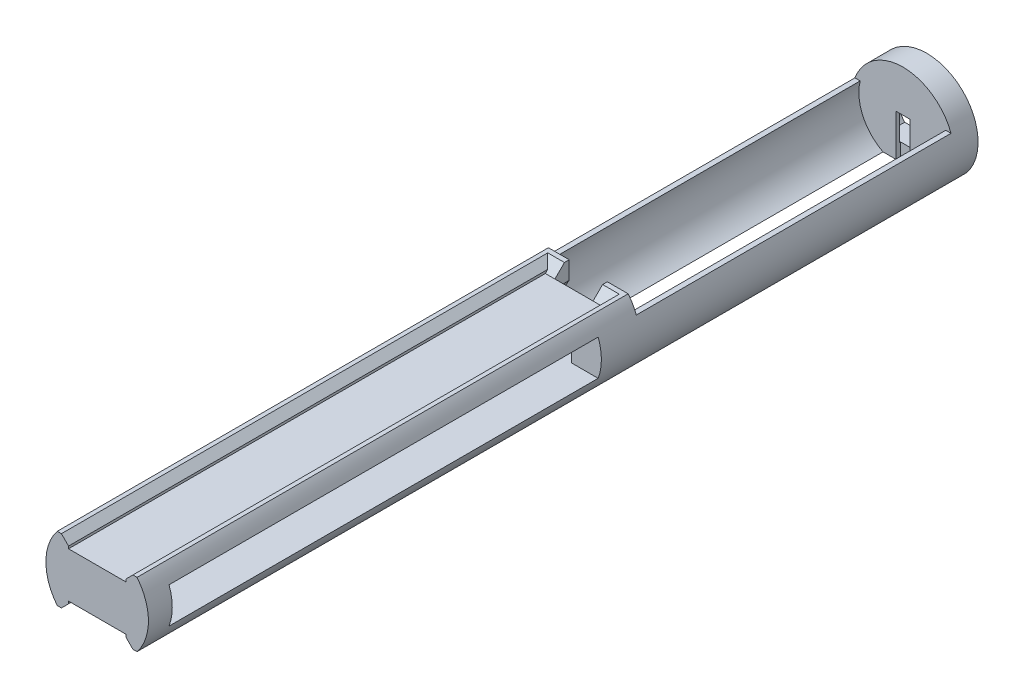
ISO-10303-21;
HEADER;
FILE_DESCRIPTION(('STEP AP214'),'2;1');
FILE_NAME('part.step','',(''),(''),'','','');
FILE_SCHEMA(('AUTOMOTIVE_DESIGN { 1 0 10303 214 1 1 1 1 }'));
ENDSEC;
DATA;
#1=APPLICATION_CONTEXT('core data for automotive mechanical design processes');
#2=APPLICATION_PROTOCOL_DEFINITION('international standard','automotive_design',2000,#1);
#3=PRODUCT_CONTEXT('',#1,'mechanical');
#4=PRODUCT('Part','Part','',(#3));
#5=PRODUCT_RELATED_PRODUCT_CATEGORY('part','',(#4));
#6=PRODUCT_DEFINITION_FORMATION('','',#4);
#7=PRODUCT_DEFINITION_CONTEXT('part definition',#1,'design');
#8=PRODUCT_DEFINITION('design','',#6,#7);
#9=PRODUCT_DEFINITION_SHAPE('','',#8);
#10=(LENGTH_UNIT() NAMED_UNIT(*) SI_UNIT(.MILLI.,.METRE.));
#11=(NAMED_UNIT(*) PLANE_ANGLE_UNIT() SI_UNIT($,.RADIAN.));
#12=(NAMED_UNIT(*) SI_UNIT($,.STERADIAN.) SOLID_ANGLE_UNIT());
#13=UNCERTAINTY_MEASURE_WITH_UNIT(LENGTH_MEASURE(1.E-05),#10,'distance_accuracy_value','');
#14=(GEOMETRIC_REPRESENTATION_CONTEXT(3) GLOBAL_UNCERTAINTY_ASSIGNED_CONTEXT((#13)) GLOBAL_UNIT_ASSIGNED_CONTEXT((#10,
#11,#12)) REPRESENTATION_CONTEXT('',''));
#15=CARTESIAN_POINT('',(0.,0.,0.));
#16=DIRECTION('',(0.,0.,1.));
#17=DIRECTION('',(1.,0.,0.));
#18=AXIS2_PLACEMENT_3D('',#15,#16,#17);
#19=CARTESIAN_POINT('',(20.,3.75000000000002,5.));
#20=DIRECTION('',(0.,0.,1.));
#21=DIRECTION('',(0.,-1.,0.));
#22=AXIS2_PLACEMENT_3D('',#19,#20,#21);
#23=PLANE('',#22);
#24=DIRECTION('',(-1.,0.,0.));
#25=VECTOR('',#24,1.);
#26=CARTESIAN_POINT('',(20.,3.75000000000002,5.));
#27=LINE('',#26,#25);
#28=CARTESIAN_POINT('',(10.0747208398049,3.75000000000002,5.));
#29=VERTEX_POINT('',#28);
#30=CARTESIAN_POINT('',(4.5,3.74999999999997,5.));
#31=VERTEX_POINT('',#30);
#32=EDGE_CURVE('E435',#29,#31,#27,.T.);
#33=ORIENTED_EDGE('',*,*,#32,.T.);
#34=DIRECTION('',(0.,-1.,0.));
#35=VECTOR('',#34,1.);
#36=CARTESIAN_POINT('',(4.5,3.74999999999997,5.));
#37=LINE('',#36,#35);
#38=CARTESIAN_POINT('',(4.5,-3.75000000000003,5.));
#39=VERTEX_POINT('',#38);
#40=EDGE_CURVE('E445',#31,#39,#37,.T.);
#41=ORIENTED_EDGE('',*,*,#40,.T.);
#42=DIRECTION('',(-1.,0.,0.));
#43=VECTOR('',#42,1.);
#44=CARTESIAN_POINT('',(20.,-3.75000000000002,5.));
#45=LINE('',#44,#43);
#46=CARTESIAN_POINT('',(10.0747208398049,-3.75000000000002,5.));
#47=VERTEX_POINT('',#46);
#48=EDGE_CURVE('E878',#47,#39,#45,.T.);
#49=ORIENTED_EDGE('',*,*,#48,.F.);
#50=CARTESIAN_POINT('',(0.,0.,5.));
#51=DIRECTION('',(0.,0.,1.));
#52=DIRECTION('',(0.,-1.,0.));
#53=AXIS2_PLACEMENT_3D('',#50,#51,#52);
#54=CIRCLE('',#53,10.75);
#55=EDGE_CURVE('E458',#47,#29,#54,.T.);
#56=ORIENTED_EDGE('',*,*,#55,.T.);
#57=EDGE_LOOP('',(#33,#41,#49,#56));
#58=FACE_BOUND('',#57,.T.);
#59=ADVANCED_FACE('F41',(#58),#23,.T.);
#60=CARTESIAN_POINT('',(0.,0.,0.));
#61=DIRECTION('',(0.,0.,-1.));
#62=DIRECTION('',(-1.,0.,0.));
#63=AXIS2_PLACEMENT_3D('',#60,#61,#62);
#64=PLANE('',#63);
#65=CARTESIAN_POINT('',(0.,0.,0.));
#66=DIRECTION('',(0.,0.,1.));
#67=DIRECTION('',(1.,0.,0.));
#68=AXIS2_PLACEMENT_3D('',#65,#66,#67);
#69=CIRCLE('',#68,5.);
#70=CARTESIAN_POINT('',(-4.,3.,0.));
#71=VERTEX_POINT('',#70);
#72=CARTESIAN_POINT('',(-4.,-3.,0.));
#73=VERTEX_POINT('',#72);
#74=EDGE_CURVE('E789',#71,#73,#69,.T.);
#75=ORIENTED_EDGE('',*,*,#74,.F.);
#76=DIRECTION('',(0.,1.,0.));
#77=VECTOR('',#76,1.);
#78=CARTESIAN_POINT('',(-4.,0.,0.));
#79=LINE('',#78,#77);
#80=CARTESIAN_POINT('',(-4.,4.75,0.));
#81=VERTEX_POINT('',#80);
#82=EDGE_CURVE('E610',#71,#81,#79,.T.);
#83=ORIENTED_EDGE('',*,*,#82,.T.);
#84=DIRECTION('',(-1.,0.,0.));
#85=VECTOR('',#84,1.);
#86=CARTESIAN_POINT('',(-6.,4.75,0.));
#87=LINE('',#86,#85);
#88=CARTESIAN_POINT('',(4.,4.75,0.));
#89=VERTEX_POINT('',#88);
#90=EDGE_CURVE('E539',#89,#81,#87,.T.);
#91=ORIENTED_EDGE('',*,*,#90,.F.);
#92=DIRECTION('',(0.,1.,0.));
#93=VECTOR('',#92,1.);
#94=CARTESIAN_POINT('',(4.,6.75,0.));
#95=LINE('',#94,#93);
#96=CARTESIAN_POINT('',(4.,3.,0.));
#97=VERTEX_POINT('',#96);
#98=EDGE_CURVE('E836',#97,#89,#95,.T.);
#99=ORIENTED_EDGE('',*,*,#98,.F.);
#100=CARTESIAN_POINT('',(0.,0.,0.));
#101=DIRECTION('',(0.,0.,1.));
#102=DIRECTION('',(-1.,0.,0.));
#103=AXIS2_PLACEMENT_3D('',#100,#101,#102);
#104=CIRCLE('',#103,5.);
#105=CARTESIAN_POINT('',(4.,-3.,0.));
#106=VERTEX_POINT('',#105);
#107=EDGE_CURVE('E830',#106,#97,#104,.T.);
#108=ORIENTED_EDGE('',*,*,#107,.F.);
#109=DIRECTION('',(0.,1.,0.));
#110=VECTOR('',#109,1.);
#111=CARTESIAN_POINT('',(4.,-3.,0.));
#112=LINE('',#111,#110);
#113=CARTESIAN_POINT('',(4.,-4.75,0.));
#114=VERTEX_POINT('',#113);
#115=EDGE_CURVE('E609',#114,#106,#112,.T.);
#116=ORIENTED_EDGE('',*,*,#115,.F.);
#117=DIRECTION('',(1.,0.,0.));
#118=VECTOR('',#117,1.);
#119=CARTESIAN_POINT('',(-6.,-4.75,0.));
#120=LINE('',#119,#118);
#121=CARTESIAN_POINT('',(-4.,-4.75,0.));
#122=VERTEX_POINT('',#121);
#123=EDGE_CURVE('E543',#122,#114,#120,.T.);
#124=ORIENTED_EDGE('',*,*,#123,.F.);
#125=DIRECTION('',(0.,-1.,0.));
#126=VECTOR('',#125,1.);
#127=CARTESIAN_POINT('',(-4.,-3.,0.));
#128=LINE('',#127,#126);
#129=EDGE_CURVE('E794',#73,#122,#128,.T.);
#130=ORIENTED_EDGE('',*,*,#129,.F.);
#131=EDGE_LOOP('',(#75,#83,#91,#99,#108,#116,#124,#130));
#132=FACE_BOUND('',#131,.T.);
#133=CARTESIAN_POINT('',(0.,0.,0.));
#134=DIRECTION('',(0.,0.,-1.));
#135=DIRECTION('',(-1.,0.,0.));
#136=AXIS2_PLACEMENT_3D('',#133,#134,#135);
#137=CIRCLE('',#136,3.75);
#138=CARTESIAN_POINT('',(1.5,3.43693177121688,0.));
#139=VERTEX_POINT('',#138);
#140=CARTESIAN_POINT('',(1.5,-3.43693177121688,0.));
#141=VERTEX_POINT('',#140);
#142=EDGE_CURVE('E725',#139,#141,#137,.T.);
#143=ORIENTED_EDGE('',*,*,#142,.F.);
#144=DIRECTION('',(0.,-1.,0.));
#145=VECTOR('',#144,1.);
#146=CARTESIAN_POINT('',(1.5,3.74999999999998,0.));
#147=LINE('',#146,#145);
#148=CARTESIAN_POINT('',(1.5,3.74999999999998,0.));
#149=VERTEX_POINT('',#148);
#150=EDGE_CURVE('E455',#149,#139,#147,.T.);
#151=ORIENTED_EDGE('',*,*,#150,.F.);
#152=DIRECTION('',(-1.,0.,0.));
#153=VECTOR('',#152,1.);
#154=CARTESIAN_POINT('',(1.5,3.74999999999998,0.));
#155=LINE('',#154,#153);
#156=CARTESIAN_POINT('',(-1.5,3.74999999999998,0.));
#157=VERTEX_POINT('',#156);
#158=EDGE_CURVE('E438',#149,#157,#155,.T.);
#159=ORIENTED_EDGE('',*,*,#158,.T.);
#160=DIRECTION('',(0.,-1.,0.));
#161=VECTOR('',#160,1.);
#162=CARTESIAN_POINT('',(-1.5,3.74999999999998,0.));
#163=LINE('',#162,#161);
#164=CARTESIAN_POINT('',(-1.5,3.43693177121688,0.));
#165=VERTEX_POINT('',#164);
#166=EDGE_CURVE('E712',#157,#165,#163,.T.);
#167=ORIENTED_EDGE('',*,*,#166,.T.);
#168=CARTESIAN_POINT('',(-1.5,-3.43693177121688,0.));
#169=VERTEX_POINT('',#168);
#170=EDGE_CURVE('E719',#169,#165,#137,.T.);
#171=ORIENTED_EDGE('',*,*,#170,.F.);
#172=CARTESIAN_POINT('',(-1.5,-3.75000000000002,0.));
#173=VERTEX_POINT('',#172);
#174=EDGE_CURVE('E63',#169,#173,#163,.T.);
#175=ORIENTED_EDGE('',*,*,#174,.T.);
#176=DIRECTION('',(-1.,0.,0.));
#177=VECTOR('',#176,1.);
#178=CARTESIAN_POINT('',(1.5,-3.75000000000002,0.));
#179=LINE('',#178,#177);
#180=CARTESIAN_POINT('',(1.5,-3.75000000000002,0.));
#181=VERTEX_POINT('',#180);
#182=EDGE_CURVE('E907',#181,#173,#179,.T.);
#183=ORIENTED_EDGE('',*,*,#182,.F.);
#184=EDGE_CURVE('E721',#141,#181,#147,.T.);
#185=ORIENTED_EDGE('',*,*,#184,.F.);
#186=EDGE_LOOP('',(#143,#151,#159,#167,#171,#175,#183,#185));
#187=FACE_BOUND('',#186,.T.);
#188=ADVANCED_FACE('F718',(#132,#187),#64,.T.);
#189=CARTESIAN_POINT('',(-4.5,-3.75000000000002,5.));
#190=VERTEX_POINT('',#189);
#191=CARTESIAN_POINT('',(-10.0747208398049,-3.75000000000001,5.));
#192=VERTEX_POINT('',#191);
#193=EDGE_CURVE('E877',#190,#192,#45,.T.);
#194=ORIENTED_EDGE('',*,*,#193,.F.);
#195=DIRECTION('',(0.,-1.,0.));
#196=VECTOR('',#195,1.);
#197=CARTESIAN_POINT('',(-4.5,3.74999999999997,5.));
#198=LINE('',#197,#196);
#199=CARTESIAN_POINT('',(-4.5,3.74999999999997,5.));
#200=VERTEX_POINT('',#199);
#201=EDGE_CURVE('E57',#200,#190,#198,.T.);
#202=ORIENTED_EDGE('',*,*,#201,.F.);
#203=CARTESIAN_POINT('',(-10.0747208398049,3.75000000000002,5.));
#204=VERTEX_POINT('',#203);
#205=EDGE_CURVE('E461',#200,#204,#27,.T.);
#206=ORIENTED_EDGE('',*,*,#205,.T.);
#207=CARTESIAN_POINT('',(0.,0.,5.));
#208=DIRECTION('',(0.,0.,1.));
#209=DIRECTION('',(0.,-1.,0.));
#210=AXIS2_PLACEMENT_3D('',#207,#208,#209);
#211=CIRCLE('',#210,10.75);
#212=EDGE_CURVE('E477',#204,#192,#211,.T.);
#213=ORIENTED_EDGE('',*,*,#212,.T.);
#214=EDGE_LOOP('',(#194,#202,#206,#213));
#215=FACE_BOUND('',#214,.T.);
#216=ADVANCED_FACE('F896',(#215),#23,.T.);
#217=CARTESIAN_POINT('',(0.,0.,5.));
#218=DIRECTION('',(0.,0.,-1.));
#219=DIRECTION('',(-1.,0.,0.));
#220=AXIS2_PLACEMENT_3D('',#217,#218,#219);
#221=CYLINDRICAL_SURFACE('',#220,3.75);
#222=CARTESIAN_POINT('',(0.,0.,-2.5));
#223=DIRECTION('',(-0.857492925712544,0.,0.514495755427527));
#224=DIRECTION('',(-0.514495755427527,0.,-0.857492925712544));
#225=AXIS2_PLACEMENT_3D('',#222,#223,#224);
#226=ELLIPSE('',#225,7.28868986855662,3.75);
#227=EDGE_CURVE('E11',#139,#141,#226,.F.);
#228=ORIENTED_EDGE('',*,*,#227,.F.);
#229=ORIENTED_EDGE('',*,*,#142,.T.);
#230=EDGE_LOOP('',(#228,#229));
#231=FACE_BOUND('',#230,.T.);
#232=ADVANCED_FACE('F1276',(#231),#221,.F.);
#233=CARTESIAN_POINT('',(0.,0.,-2.5));
#234=DIRECTION('',(0.857492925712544,0.,0.514495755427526));
#235=DIRECTION('',(0.514495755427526,0.,-0.857492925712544));
#236=AXIS2_PLACEMENT_3D('',#233,#234,#235);
#237=ELLIPSE('',#236,7.28868986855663,3.75);
#238=EDGE_CURVE('E50',#169,#165,#237,.F.);
#239=ORIENTED_EDGE('',*,*,#238,.F.);
#240=ORIENTED_EDGE('',*,*,#170,.T.);
#241=EDGE_LOOP('',(#239,#240));
#242=FACE_BOUND('',#241,.T.);
#243=ADVANCED_FACE('F723',(#242),#221,.F.);
#244=CARTESIAN_POINT('',(0.,0.,-74.));
#245=DIRECTION('',(0.,0.,-1.));
#246=DIRECTION('',(-1.,0.,0.));
#247=AXIS2_PLACEMENT_3D('',#244,#245,#246);
#248=PLANE('',#247);
#249=DIRECTION('',(0.,-1.,0.));
#250=VECTOR('',#249,1.);
#251=CARTESIAN_POINT('',(7.25,-6.75,-74.));
#252=LINE('',#251,#250);
#253=CARTESIAN_POINT('',(7.25,2.2,-74.));
#254=VERTEX_POINT('',#253);
#255=CARTESIAN_POINT('',(7.25,-6.75,-74.));
#256=VERTEX_POINT('',#255);
#257=EDGE_CURVE('E973',#254,#256,#252,.T.);
#258=ORIENTED_EDGE('',*,*,#257,.F.);
#259=DIRECTION('',(1.,0.,0.));
#260=VECTOR('',#259,1.);
#261=CARTESIAN_POINT('',(7.25,2.2,-74.));
#262=LINE('',#261,#260);
#263=CARTESIAN_POINT('',(5.7959037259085,2.2,-74.));
#264=VERTEX_POINT('',#263);
#265=EDGE_CURVE('E962',#264,#254,#262,.T.);
#266=ORIENTED_EDGE('',*,*,#265,.F.);
#267=CARTESIAN_POINT('',(0.,0.,-74.));
#268=DIRECTION('',(0.,0.,-1.));
#269=DIRECTION('',(-1.,0.,0.));
#270=AXIS2_PLACEMENT_3D('',#267,#268,#269);
#271=CIRCLE('',#270,6.19939513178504);
#272=CARTESIAN_POINT('',(4.65,4.1,-74.));
#273=VERTEX_POINT('',#272);
#274=EDGE_CURVE('E1053',#273,#264,#271,.T.);
#275=ORIENTED_EDGE('',*,*,#274,.F.);
#276=DIRECTION('',(1.,0.,0.));
#277=VECTOR('',#276,1.);
#278=CARTESIAN_POINT('',(4.65,4.1,-74.));
#279=LINE('',#278,#277);
#280=CARTESIAN_POINT('',(-4.65,4.1,-74.));
#281=VERTEX_POINT('',#280);
#282=EDGE_CURVE('E1048',#281,#273,#279,.T.);
#283=ORIENTED_EDGE('',*,*,#282,.F.);
#284=CARTESIAN_POINT('',(0.,0.,-74.));
#285=DIRECTION('',(0.,0.,-1.));
#286=DIRECTION('',(-1.,0.,0.));
#287=AXIS2_PLACEMENT_3D('',#284,#285,#286);
#288=CIRCLE('',#287,6.19939513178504);
#289=CARTESIAN_POINT('',(-5.7959037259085,2.2,-74.));
#290=VERTEX_POINT('',#289);
#291=EDGE_CURVE('E986',#290,#281,#288,.T.);
#292=ORIENTED_EDGE('',*,*,#291,.F.);
#293=DIRECTION('',(1.,0.,0.));
#294=VECTOR('',#293,1.);
#295=CARTESIAN_POINT('',(-7.25,2.2,-74.));
#296=LINE('',#295,#294);
#297=CARTESIAN_POINT('',(-7.25,2.2,-74.));
#298=VERTEX_POINT('',#297);
#299=EDGE_CURVE('E1012',#298,#290,#296,.T.);
#300=ORIENTED_EDGE('',*,*,#299,.F.);
#301=DIRECTION('',(0.,1.,0.));
#302=VECTOR('',#301,1.);
#303=CARTESIAN_POINT('',(-7.25,-6.75,-74.));
#304=LINE('',#303,#302);
#305=CARTESIAN_POINT('',(-7.25,-6.75,-74.));
#306=VERTEX_POINT('',#305);
#307=EDGE_CURVE('E956',#306,#298,#304,.T.);
#308=ORIENTED_EDGE('',*,*,#307,.F.);
#309=DIRECTION('',(-1.,0.,0.));
#310=VECTOR('',#309,1.);
#311=CARTESIAN_POINT('',(8.36660026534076,-6.75,-74.));
#312=LINE('',#311,#310);
#313=CARTESIAN_POINT('',(-8.36660026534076,-6.75,-74.));
#314=VERTEX_POINT('',#313);
#315=EDGE_CURVE('E735',#306,#314,#312,.T.);
#316=ORIENTED_EDGE('',*,*,#315,.T.);
#317=CARTESIAN_POINT('',(0.,0.,-74.));
#318=DIRECTION('',(0.,0.,-1.));
#319=DIRECTION('',(-1.,0.,0.));
#320=AXIS2_PLACEMENT_3D('',#317,#318,#319);
#321=CIRCLE('',#320,10.75);
#322=CARTESIAN_POINT('',(8.36660026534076,-6.75,-74.));
#323=VERTEX_POINT('',#322);
#324=EDGE_CURVE('E1074',#314,#323,#321,.T.);
#325=ORIENTED_EDGE('',*,*,#324,.T.);
#326=EDGE_CURVE('E726',#323,#256,#312,.T.);
#327=ORIENTED_EDGE('',*,*,#326,.T.);
#328=EDGE_LOOP('',(#258,#266,#275,#283,#292,#300,#308,#316,#325,#327));
#329=FACE_BOUND('',#328,.T.);
#330=ADVANCED_FACE('F1191',(#329),#248,.T.);
#331=CARTESIAN_POINT('',(0.,0.,-3.));
#332=DIRECTION('',(0.,0.,-1.));
#333=DIRECTION('',(-1.,0.,0.));
#334=AXIS2_PLACEMENT_3D('',#331,#332,#333);
#335=PLANE('',#334);
#336=DIRECTION('',(-1.,0.,0.));
#337=VECTOR('',#336,1.);
#338=CARTESIAN_POINT('',(-4.,-6.75,-3.));
#339=LINE('',#338,#337);
#340=CARTESIAN_POINT('',(-4.,-6.75,-3.));
#341=VERTEX_POINT('',#340);
#342=CARTESIAN_POINT('',(-4.18330013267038,-6.75,-3.));
#343=VERTEX_POINT('',#342);
#344=EDGE_CURVE('E806',#341,#343,#339,.T.);
#345=ORIENTED_EDGE('',*,*,#344,.T.);
#346=CARTESIAN_POINT('',(0.,1.5,-3.));
#347=DIRECTION('',(0.,0.,-1.));
#348=DIRECTION('',(-1.,0.,0.));
#349=AXIS2_PLACEMENT_3D('',#346,#347,#348);
#350=CIRCLE('',#349,9.25);
#351=CARTESIAN_POINT('',(-8.97217922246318,3.75,-3.));
#352=VERTEX_POINT('',#351);
#353=EDGE_CURVE('E731',#343,#352,#350,.T.);
#354=ORIENTED_EDGE('',*,*,#353,.T.);
#355=DIRECTION('',(-1.,0.,0.));
#356=VECTOR('',#355,1.);
#357=CARTESIAN_POINT('',(0.,3.75,-3.));
#358=LINE('',#357,#356);
#359=CARTESIAN_POINT('',(-10.0747208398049,3.75,-3.));
#360=VERTEX_POINT('',#359);
#361=EDGE_CURVE('E745',#352,#360,#358,.T.);
#362=ORIENTED_EDGE('',*,*,#361,.T.);
#363=CARTESIAN_POINT('',(0.,0.,-3.));
#364=DIRECTION('',(0.,0.,-1.));
#365=DIRECTION('',(-1.,0.,0.));
#366=AXIS2_PLACEMENT_3D('',#363,#364,#365);
#367=CIRCLE('',#366,10.75);
#368=CARTESIAN_POINT('',(-8.36660026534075,6.75,-3.));
#369=VERTEX_POINT('',#368);
#370=EDGE_CURVE('E790',#360,#369,#367,.T.);
#371=ORIENTED_EDGE('',*,*,#370,.T.);
#372=DIRECTION('',(1.,0.,0.));
#373=VECTOR('',#372,1.);
#374=CARTESIAN_POINT('',(-4.,6.75,-3.));
#375=LINE('',#374,#373);
#376=CARTESIAN_POINT('',(-4.,6.75,-3.));
#377=VERTEX_POINT('',#376);
#378=EDGE_CURVE('E793',#369,#377,#375,.T.);
#379=ORIENTED_EDGE('',*,*,#378,.T.);
#380=DIRECTION('',(0.,-1.,0.));
#381=VECTOR('',#380,1.);
#382=CARTESIAN_POINT('',(-4.,6.75,-3.));
#383=LINE('',#382,#381);
#384=CARTESIAN_POINT('',(-4.,3.,-3.));
#385=VERTEX_POINT('',#384);
#386=EDGE_CURVE('E797',#377,#385,#383,.T.);
#387=ORIENTED_EDGE('',*,*,#386,.T.);
#388=CARTESIAN_POINT('',(0.,0.,-3.));
#389=DIRECTION('',(0.,0.,1.));
#390=DIRECTION('',(1.,0.,0.));
#391=AXIS2_PLACEMENT_3D('',#388,#389,#390);
#392=CIRCLE('',#391,5.);
#393=CARTESIAN_POINT('',(-4.,-3.,-3.));
#394=VERTEX_POINT('',#393);
#395=EDGE_CURVE('E800',#385,#394,#392,.T.);
#396=ORIENTED_EDGE('',*,*,#395,.T.);
#397=DIRECTION('',(0.,-1.,0.));
#398=VECTOR('',#397,1.);
#399=CARTESIAN_POINT('',(-4.,-3.,-3.));
#400=LINE('',#399,#398);
#401=EDGE_CURVE('E803',#394,#341,#400,.T.);
#402=ORIENTED_EDGE('',*,*,#401,.T.);
#403=EDGE_LOOP('',(#345,#354,#362,#371,#379,#387,#396,#402));
#404=FACE_BOUND('',#403,.T.);
#405=ADVANCED_FACE('F1116',(#404),#335,.T.);
#406=CARTESIAN_POINT('',(0.,0.,-3.));
#407=DIRECTION('',(0.,0.,-1.));
#408=DIRECTION('',(-1.,0.,0.));
#409=AXIS2_PLACEMENT_3D('',#406,#407,#408);
#410=PLANE('',#409);
#411=CARTESIAN_POINT('',(0.,0.,-3.));
#412=DIRECTION('',(0.,0.,-1.));
#413=DIRECTION('',(-1.,0.,0.));
#414=AXIS2_PLACEMENT_3D('',#411,#412,#413);
#415=CIRCLE('',#414,10.75);
#416=CARTESIAN_POINT('',(8.36660026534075,6.75,-3.));
#417=VERTEX_POINT('',#416);
#418=CARTESIAN_POINT('',(10.0747208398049,3.75,-3.));
#419=VERTEX_POINT('',#418);
#420=EDGE_CURVE('E831',#417,#419,#415,.T.);
#421=ORIENTED_EDGE('',*,*,#420,.T.);
#422=DIRECTION('',(-1.,0.,0.));
#423=VECTOR('',#422,1.);
#424=CARTESIAN_POINT('',(0.,3.75,-3.));
#425=LINE('',#424,#423);
#426=CARTESIAN_POINT('',(8.97217922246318,3.75,-3.));
#427=VERTEX_POINT('',#426);
#428=EDGE_CURVE('E764',#419,#427,#425,.T.);
#429=ORIENTED_EDGE('',*,*,#428,.T.);
#430=CARTESIAN_POINT('',(0.,1.5,-3.));
#431=DIRECTION('',(0.,0.,-1.));
#432=DIRECTION('',(-1.,0.,0.));
#433=AXIS2_PLACEMENT_3D('',#430,#431,#432);
#434=CIRCLE('',#433,9.25);
#435=CARTESIAN_POINT('',(4.18330013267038,-6.75,-3.));
#436=VERTEX_POINT('',#435);
#437=EDGE_CURVE('E770',#427,#436,#434,.T.);
#438=ORIENTED_EDGE('',*,*,#437,.T.);
#439=DIRECTION('',(-1.,0.,0.));
#440=VECTOR('',#439,1.);
#441=CARTESIAN_POINT('',(8.36660026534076,-6.75,-3.));
#442=LINE('',#441,#440);
#443=CARTESIAN_POINT('',(4.,-6.75,-3.));
#444=VERTEX_POINT('',#443);
#445=EDGE_CURVE('E835',#436,#444,#442,.T.);
#446=ORIENTED_EDGE('',*,*,#445,.T.);
#447=DIRECTION('',(0.,1.,0.));
#448=VECTOR('',#447,1.);
#449=CARTESIAN_POINT('',(4.,-3.,-3.));
#450=LINE('',#449,#448);
#451=CARTESIAN_POINT('',(4.,-3.,-3.));
#452=VERTEX_POINT('',#451);
#453=EDGE_CURVE('E839',#444,#452,#450,.T.);
#454=ORIENTED_EDGE('',*,*,#453,.T.);
#455=CARTESIAN_POINT('',(0.,0.,-3.));
#456=DIRECTION('',(0.,0.,1.));
#457=DIRECTION('',(-1.,0.,0.));
#458=AXIS2_PLACEMENT_3D('',#455,#456,#457);
#459=CIRCLE('',#458,5.);
#460=CARTESIAN_POINT('',(4.,3.,-3.));
#461=VERTEX_POINT('',#460);
#462=EDGE_CURVE('E842',#452,#461,#459,.T.);
#463=ORIENTED_EDGE('',*,*,#462,.T.);
#464=DIRECTION('',(0.,1.,0.));
#465=VECTOR('',#464,1.);
#466=CARTESIAN_POINT('',(4.,6.75,-3.));
#467=LINE('',#466,#465);
#468=CARTESIAN_POINT('',(4.,6.75,-3.));
#469=VERTEX_POINT('',#468);
#470=EDGE_CURVE('E845',#461,#469,#467,.T.);
#471=ORIENTED_EDGE('',*,*,#470,.T.);
#472=DIRECTION('',(1.,0.,0.));
#473=VECTOR('',#472,1.);
#474=CARTESIAN_POINT('',(8.36660026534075,6.75,-3.));
#475=LINE('',#474,#473);
#476=EDGE_CURVE('E848',#469,#417,#475,.T.);
#477=ORIENTED_EDGE('',*,*,#476,.T.);
#478=EDGE_LOOP('',(#421,#429,#438,#446,#454,#463,#471,#477));
#479=FACE_BOUND('',#478,.T.);
#480=ADVANCED_FACE('F1224',(#479),#410,.T.);
#481=CARTESIAN_POINT('',(0.,0.,100.));
#482=DIRECTION('',(0.,0.,-1.));
#483=DIRECTION('',(-1.,0.,0.));
#484=AXIS2_PLACEMENT_3D('',#481,#482,#483);
#485=CYLINDRICAL_SURFACE('',#484,10.75);
#486=DIRECTION('',(0.,0.,-1.));
#487=VECTOR('',#486,1.);
#488=CARTESIAN_POINT('',(8.36660026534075,-6.75,100.));
#489=LINE('',#488,#487);
#490=CARTESIAN_POINT('',(8.36660026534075,-6.75,100.));
#491=VERTEX_POINT('',#490);
#492=EDGE_CURVE('E533',#491,#323,#489,.T.);
#493=ORIENTED_EDGE('',*,*,#492,.T.);
#494=ORIENTED_EDGE('',*,*,#324,.F.);
#495=DIRECTION('',(0.,0.,-1.));
#496=VECTOR('',#495,1.);
#497=CARTESIAN_POINT('',(-8.36660026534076,-6.75,100.));
#498=LINE('',#497,#496);
#499=CARTESIAN_POINT('',(-8.36660026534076,-6.75,100.));
#500=VERTEX_POINT('',#499);
#501=EDGE_CURVE('E566',#500,#314,#498,.T.);
#502=ORIENTED_EDGE('',*,*,#501,.F.);
#503=CARTESIAN_POINT('',(0.,0.,100.));
#504=DIRECTION('',(0.,0.,1.));
#505=DIRECTION('',(1.,0.,0.));
#506=AXIS2_PLACEMENT_3D('',#503,#504,#505);
#507=CIRCLE('',#506,10.75);
#508=CARTESIAN_POINT('',(-8.36660026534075,6.75,100.));
#509=VERTEX_POINT('',#508);
#510=EDGE_CURVE('E508',#509,#500,#507,.T.);
#511=ORIENTED_EDGE('',*,*,#510,.F.);
#512=DIRECTION('',(0.,0.,-1.));
#513=VECTOR('',#512,1.);
#514=CARTESIAN_POINT('',(-8.36660026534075,6.75,100.));
#515=LINE('',#514,#513);
#516=EDGE_CURVE('E570',#509,#369,#515,.T.);
#517=ORIENTED_EDGE('',*,*,#516,.T.);
#518=ORIENTED_EDGE('',*,*,#370,.F.);
#519=DIRECTION('',(0.,0.,1.));
#520=VECTOR('',#519,1.);
#521=CARTESIAN_POINT('',(-10.0747208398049,3.75,-69.));
#522=LINE('',#521,#520);
#523=CARTESIAN_POINT('',(-10.0747208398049,3.75,-69.));
#524=VERTEX_POINT('',#523);
#525=EDGE_CURVE('E758',#524,#360,#522,.T.);
#526=ORIENTED_EDGE('',*,*,#525,.F.);
#527=CARTESIAN_POINT('',(0.,0.,-69.));
#528=DIRECTION('',(0.,0.,-1.));
#529=DIRECTION('',(-1.,0.,0.));
#530=AXIS2_PLACEMENT_3D('',#527,#528,#529);
#531=CIRCLE('',#530,10.75);
#532=CARTESIAN_POINT('',(10.0747208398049,3.75,-69.));
#533=VERTEX_POINT('',#532);
#534=EDGE_CURVE('E1063',#524,#533,#531,.T.);
#535=ORIENTED_EDGE('',*,*,#534,.T.);
#536=DIRECTION('',(0.,0.,1.));
#537=VECTOR('',#536,1.);
#538=CARTESIAN_POINT('',(10.0747208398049,3.75,-69.));
#539=LINE('',#538,#537);
#540=EDGE_CURVE('E786',#533,#419,#539,.T.);
#541=ORIENTED_EDGE('',*,*,#540,.T.);
#542=ORIENTED_EDGE('',*,*,#420,.F.);
#543=DIRECTION('',(0.,0.,-1.));
#544=VECTOR('',#543,1.);
#545=CARTESIAN_POINT('',(8.36660026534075,6.75,100.));
#546=LINE('',#545,#544);
#547=CARTESIAN_POINT('',(8.36660026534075,6.75,100.));
#548=VERTEX_POINT('',#547);
#549=EDGE_CURVE('E594',#548,#417,#546,.T.);
#550=ORIENTED_EDGE('',*,*,#549,.F.);
#551=CARTESIAN_POINT('',(0.,0.,100.));
#552=DIRECTION('',(0.,0.,1.));
#553=DIRECTION('',(-1.,0.,0.));
#554=AXIS2_PLACEMENT_3D('',#551,#552,#553);
#555=CIRCLE('',#554,10.75);
#556=EDGE_CURVE('E482',#491,#548,#555,.T.);
#557=ORIENTED_EDGE('',*,*,#556,.F.);
#558=EDGE_LOOP('',(#493,#494,#502,#511,#517,#518,#526,#535,#541,#542,#550,#557));
#559=FACE_BOUND('',#558,.T.);
#560=ORIENTED_EDGE('',*,*,#55,.F.);
#561=DIRECTION('',(0.,0.,-1.));
#562=VECTOR('',#561,1.);
#563=CARTESIAN_POINT('',(10.0747208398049,-3.75000000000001,100.));
#564=LINE('',#563,#562);
#565=CARTESIAN_POINT('',(10.0747208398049,-3.75000000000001,95.));
#566=VERTEX_POINT('',#565);
#567=EDGE_CURVE('E597',#566,#47,#564,.T.);
#568=ORIENTED_EDGE('',*,*,#567,.F.);
#569=CARTESIAN_POINT('',(0.,0.,95.));
#570=DIRECTION('',(0.,0.,-1.));
#571=DIRECTION('',(0.,1.,0.));
#572=AXIS2_PLACEMENT_3D('',#569,#570,#571);
#573=CIRCLE('',#572,10.75);
#574=CARTESIAN_POINT('',(10.0747208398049,3.74999999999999,95.));
#575=VERTEX_POINT('',#574);
#576=EDGE_CURVE('E600',#575,#566,#573,.T.);
#577=ORIENTED_EDGE('',*,*,#576,.F.);
#578=DIRECTION('',(0.,0.,-1.));
#579=VECTOR('',#578,1.);
#580=CARTESIAN_POINT('',(10.0747208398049,3.74999999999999,100.));
#581=LINE('',#580,#579);
#582=EDGE_CURVE('E604',#29,#575,#581,.F.);
#583=ORIENTED_EDGE('',*,*,#582,.F.);
#584=EDGE_LOOP('',(#560,#568,#577,#583));
#585=FACE_BOUND('',#584,.T.);
#586=ORIENTED_EDGE('',*,*,#212,.F.);
#587=DIRECTION('',(0.,0.,-1.));
#588=VECTOR('',#587,1.);
#589=CARTESIAN_POINT('',(-10.0747208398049,3.74999999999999,100.));
#590=LINE('',#589,#588);
#591=CARTESIAN_POINT('',(-10.0747208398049,3.74999999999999,95.));
#592=VERTEX_POINT('',#591);
#593=EDGE_CURVE('E473',#592,#204,#590,.T.);
#594=ORIENTED_EDGE('',*,*,#593,.F.);
#595=CARTESIAN_POINT('',(0.,0.,95.));
#596=DIRECTION('',(0.,0.,-1.));
#597=DIRECTION('',(0.,1.,0.));
#598=AXIS2_PLACEMENT_3D('',#595,#596,#597);
#599=CIRCLE('',#598,10.75);
#600=CARTESIAN_POINT('',(-10.0747208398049,-3.75000000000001,95.));
#601=VERTEX_POINT('',#600);
#602=EDGE_CURVE('E465',#601,#592,#599,.T.);
#603=ORIENTED_EDGE('',*,*,#602,.F.);
#604=DIRECTION('',(0.,0.,-1.));
#605=VECTOR('',#604,1.);
#606=CARTESIAN_POINT('',(-10.0747208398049,-3.75000000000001,100.));
#607=LINE('',#606,#605);
#608=EDGE_CURVE('E460',#192,#601,#607,.F.);
#609=ORIENTED_EDGE('',*,*,#608,.F.);
#610=EDGE_LOOP('',(#586,#594,#603,#609));
#611=FACE_BOUND('',#610,.T.);
#612=ADVANCED_FACE('F892',(#559,#585,#611),#485,.T.);
#613=CARTESIAN_POINT('',(7.5,6.75,100.));
#614=DIRECTION('',(0.,-1.,0.));
#615=DIRECTION('',(0.,0.,-1.));
#616=AXIS2_PLACEMENT_3D('',#613,#614,#615);
#617=PLANE('',#616);
#618=DIRECTION('',(0.,0.,1.));
#619=VECTOR('',#618,1.);
#620=CARTESIAN_POINT('',(4.,6.75,-3.));
#621=LINE('',#620,#619);
#622=CARTESIAN_POINT('',(4.,6.75,-2.00000000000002));
#623=VERTEX_POINT('',#622);
#624=EDGE_CURVE('E852',#469,#623,#621,.T.);
#625=ORIENTED_EDGE('',*,*,#624,.T.);
#626=DIRECTION('',(1.,0.,0.));
#627=VECTOR('',#626,1.);
#628=CARTESIAN_POINT('',(7.5,6.75,-2.00000000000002));
#629=LINE('',#628,#627);
#630=CARTESIAN_POINT('',(7.5,6.75,-2.00000000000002));
#631=VERTEX_POINT('',#630);
#632=EDGE_CURVE('E628',#623,#631,#629,.T.);
#633=ORIENTED_EDGE('',*,*,#632,.T.);
#634=DIRECTION('',(0.,0.,-1.));
#635=VECTOR('',#634,1.);
#636=CARTESIAN_POINT('',(7.5,6.75,100.));
#637=LINE('',#636,#635);
#638=CARTESIAN_POINT('',(7.5,6.75,100.));
#639=VERTEX_POINT('',#638);
#640=EDGE_CURVE('E591',#639,#631,#637,.T.);
#641=ORIENTED_EDGE('',*,*,#640,.F.);
#642=DIRECTION('',(-1.,0.,0.));
#643=VECTOR('',#642,1.);
#644=CARTESIAN_POINT('',(7.5,6.75,100.));
#645=LINE('',#644,#643);
#646=EDGE_CURVE('E486',#548,#639,#645,.T.);
#647=ORIENTED_EDGE('',*,*,#646,.F.);
#648=ORIENTED_EDGE('',*,*,#549,.T.);
#649=ORIENTED_EDGE('',*,*,#476,.F.);
#650=EDGE_LOOP('',(#625,#633,#641,#647,#648,#649));
#651=FACE_BOUND('',#650,.T.);
#652=ADVANCED_FACE('F1333',(#651),#617,.F.);
#653=CARTESIAN_POINT('',(6.,5.25,100.));
#654=DIRECTION('',(0.707106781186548,-0.707106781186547,0.));
#655=DIRECTION('',(0.707106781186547,0.707106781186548,0.));
#656=AXIS2_PLACEMENT_3D('',#653,#654,#655);
#657=PLANE('',#656);
#658=ORIENTED_EDGE('',*,*,#640,.T.);
#659=DIRECTION('',(0.577350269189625,0.577350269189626,-0.577350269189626));
#660=VECTOR('',#659,1.);
#661=CARTESIAN_POINT('',(-27.5,-28.25,33.));
#662=LINE('',#661,#660);
#663=CARTESIAN_POINT('',(6.,5.25,-0.500000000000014));
#664=VERTEX_POINT('',#663);
#665=EDGE_CURVE('E657',#631,#664,#662,.F.);
#666=ORIENTED_EDGE('',*,*,#665,.T.);
#667=DIRECTION('',(0.,0.,-1.));
#668=VECTOR('',#667,1.);
#669=CARTESIAN_POINT('',(6.,5.25,100.));
#670=LINE('',#669,#668);
#671=CARTESIAN_POINT('',(6.,5.25,100.));
#672=VERTEX_POINT('',#671);
#673=EDGE_CURVE('E588',#672,#664,#670,.T.);
#674=ORIENTED_EDGE('',*,*,#673,.F.);
#675=DIRECTION('',(-0.707106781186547,-0.707106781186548,0.));
#676=VECTOR('',#675,1.);
#677=CARTESIAN_POINT('',(6.,5.25,100.));
#678=LINE('',#677,#676);
#679=EDGE_CURVE('E490',#639,#672,#678,.T.);
#680=ORIENTED_EDGE('',*,*,#679,.F.);
#681=EDGE_LOOP('',(#658,#666,#674,#680));
#682=FACE_BOUND('',#681,.T.);
#683=ADVANCED_FACE('F1381',(#682),#657,.F.);
#684=CARTESIAN_POINT('',(6.,5.25,100.));
#685=DIRECTION('',(1.,0.,0.));
#686=DIRECTION('',(0.,1.,0.));
#687=AXIS2_PLACEMENT_3D('',#684,#685,#686);
#688=PLANE('',#687);
#689=ORIENTED_EDGE('',*,*,#673,.T.);
#690=DIRECTION('',(0.,0.707106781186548,-0.707106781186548));
#691=VECTOR('',#690,1.);
#692=CARTESIAN_POINT('',(5.99999999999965,-45.,49.75));
#693=LINE('',#692,#691);
#694=CARTESIAN_POINT('',(6.,4.75,0.));
#695=VERTEX_POINT('',#694);
#696=EDGE_CURVE('E661',#664,#695,#693,.F.);
#697=ORIENTED_EDGE('',*,*,#696,.T.);
#698=DIRECTION('',(0.,0.,-1.));
#699=VECTOR('',#698,1.);
#700=CARTESIAN_POINT('',(6.,4.75,100.));
#701=LINE('',#700,#699);
#702=CARTESIAN_POINT('',(6.,4.75,100.));
#703=VERTEX_POINT('',#702);
#704=EDGE_CURVE('E584',#703,#695,#701,.T.);
#705=ORIENTED_EDGE('',*,*,#704,.F.);
#706=DIRECTION('',(0.,-1.,0.));
#707=VECTOR('',#706,1.);
#708=CARTESIAN_POINT('',(6.,5.25,100.));
#709=LINE('',#708,#707);
#710=EDGE_CURVE('E493',#672,#703,#709,.T.);
#711=ORIENTED_EDGE('',*,*,#710,.F.);
#712=EDGE_LOOP('',(#689,#697,#705,#711));
#713=FACE_BOUND('',#712,.T.);
#714=ADVANCED_FACE('F1382',(#713),#688,.F.);
#715=CARTESIAN_POINT('',(-6.,4.75,100.));
#716=DIRECTION('',(0.,-1.,0.));
#717=DIRECTION('',(1.,0.,0.));
#718=AXIS2_PLACEMENT_3D('',#715,#716,#717);
#719=PLANE('',#718);
#720=EDGE_CURVE('E534',#695,#89,#87,.T.);
#721=ORIENTED_EDGE('',*,*,#720,.T.);
#722=ORIENTED_EDGE('',*,*,#90,.T.);
#723=CARTESIAN_POINT('',(-6.,4.75,0.));
#724=VERTEX_POINT('',#723);
#725=EDGE_CURVE('E481',#81,#724,#87,.T.);
#726=ORIENTED_EDGE('',*,*,#725,.T.);
#727=DIRECTION('',(0.,0.,-1.));
#728=VECTOR('',#727,1.);
#729=CARTESIAN_POINT('',(-6.,4.75,100.));
#730=LINE('',#729,#728);
#731=CARTESIAN_POINT('',(-6.,4.75,100.));
#732=VERTEX_POINT('',#731);
#733=EDGE_CURVE('E580',#732,#724,#730,.T.);
#734=ORIENTED_EDGE('',*,*,#733,.F.);
#735=DIRECTION('',(-1.,0.,0.));
#736=VECTOR('',#735,1.);
#737=CARTESIAN_POINT('',(-6.,4.75,100.));
#738=LINE('',#737,#736);
#739=EDGE_CURVE('E496',#703,#732,#738,.T.);
#740=ORIENTED_EDGE('',*,*,#739,.F.);
#741=ORIENTED_EDGE('',*,*,#704,.T.);
#742=EDGE_LOOP('',(#721,#722,#726,#734,#740,#741));
#743=FACE_BOUND('',#742,.T.);
#744=ADVANCED_FACE('F1350',(#743),#719,.F.);
#745=CARTESIAN_POINT('',(-6.,5.25,100.));
#746=DIRECTION('',(-1.,0.,0.));
#747=DIRECTION('',(0.,0.,1.));
#748=AXIS2_PLACEMENT_3D('',#745,#746,#747);
#749=PLANE('',#748);
#750=ORIENTED_EDGE('',*,*,#733,.T.);
#751=DIRECTION('',(0.,-0.707106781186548,0.707106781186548));
#752=VECTOR('',#751,1.);
#753=CARTESIAN_POINT('',(-6.,-45.,49.75));
#754=LINE('',#753,#752);
#755=CARTESIAN_POINT('',(-6.,5.25,-0.500000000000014));
#756=VERTEX_POINT('',#755);
#757=EDGE_CURVE('E664',#724,#756,#754,.F.);
#758=ORIENTED_EDGE('',*,*,#757,.T.);
#759=DIRECTION('',(0.,0.,-1.));
#760=VECTOR('',#759,1.);
#761=CARTESIAN_POINT('',(-6.,5.25,100.));
#762=LINE('',#761,#760);
#763=CARTESIAN_POINT('',(-6.,5.25,100.));
#764=VERTEX_POINT('',#763);
#765=EDGE_CURVE('E577',#764,#756,#762,.T.);
#766=ORIENTED_EDGE('',*,*,#765,.F.);
#767=DIRECTION('',(0.,1.,0.));
#768=VECTOR('',#767,1.);
#769=CARTESIAN_POINT('',(-6.,5.25,100.));
#770=LINE('',#769,#768);
#771=EDGE_CURVE('E499',#732,#764,#770,.T.);
#772=ORIENTED_EDGE('',*,*,#771,.F.);
#773=EDGE_LOOP('',(#750,#758,#766,#772));
#774=FACE_BOUND('',#773,.T.);
#775=ADVANCED_FACE('F1356',(#774),#749,.F.);
#776=CARTESIAN_POINT('',(-7.5,6.75,100.));
#777=DIRECTION('',(-0.707106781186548,-0.707106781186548,0.));
#778=DIRECTION('',(0.707106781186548,-0.707106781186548,0.));
#779=AXIS2_PLACEMENT_3D('',#776,#777,#778);
#780=PLANE('',#779);
#781=ORIENTED_EDGE('',*,*,#765,.T.);
#782=DIRECTION('',(0.577350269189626,-0.577350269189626,0.577350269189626));
#783=VECTOR('',#782,1.);
#784=CARTESIAN_POINT('',(26.5,-27.25,32.));
#785=LINE('',#784,#783);
#786=CARTESIAN_POINT('',(-7.5,6.75,-2.00000000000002));
#787=VERTEX_POINT('',#786);
#788=EDGE_CURVE('E668',#756,#787,#785,.F.);
#789=ORIENTED_EDGE('',*,*,#788,.T.);
#790=DIRECTION('',(0.,0.,-1.));
#791=VECTOR('',#790,1.);
#792=CARTESIAN_POINT('',(-7.5,6.75,100.));
#793=LINE('',#792,#791);
#794=CARTESIAN_POINT('',(-7.5,6.75,100.));
#795=VERTEX_POINT('',#794);
#796=EDGE_CURVE('E574',#795,#787,#793,.T.);
#797=ORIENTED_EDGE('',*,*,#796,.F.);
#798=DIRECTION('',(-0.707106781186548,0.707106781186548,0.));
#799=VECTOR('',#798,1.);
#800=CARTESIAN_POINT('',(-7.5,6.75,100.));
#801=LINE('',#800,#799);
#802=EDGE_CURVE('E502',#764,#795,#801,.T.);
#803=ORIENTED_EDGE('',*,*,#802,.F.);
#804=EDGE_LOOP('',(#781,#789,#797,#803));
#805=FACE_BOUND('',#804,.T.);
#806=ADVANCED_FACE('F1361',(#805),#780,.F.);
#807=CARTESIAN_POINT('',(-8.36660026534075,6.75,100.));
#808=DIRECTION('',(0.,-1.,0.));
#809=DIRECTION('',(0.,0.,-1.));
#810=AXIS2_PLACEMENT_3D('',#807,#808,#809);
#811=PLANE('',#810);
#812=ORIENTED_EDGE('',*,*,#796,.T.);
#813=DIRECTION('',(1.,0.,0.));
#814=VECTOR('',#813,1.);
#815=CARTESIAN_POINT('',(-8.36660026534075,6.75,-2.00000000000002));
#816=LINE('',#815,#814);
#817=CARTESIAN_POINT('',(-4.,6.75,-2.00000000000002));
#818=VERTEX_POINT('',#817);
#819=EDGE_CURVE('E635',#787,#818,#816,.T.);
#820=ORIENTED_EDGE('',*,*,#819,.T.);
#821=DIRECTION('',(0.,0.,1.));
#822=VECTOR('',#821,1.);
#823=CARTESIAN_POINT('',(-4.,6.75,-3.));
#824=LINE('',#823,#822);
#825=EDGE_CURVE('E826',#377,#818,#824,.T.);
#826=ORIENTED_EDGE('',*,*,#825,.F.);
#827=ORIENTED_EDGE('',*,*,#378,.F.);
#828=ORIENTED_EDGE('',*,*,#516,.F.);
#829=DIRECTION('',(-1.,0.,0.));
#830=VECTOR('',#829,1.);
#831=CARTESIAN_POINT('',(-8.36660026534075,6.75,100.));
#832=LINE('',#831,#830);
#833=EDGE_CURVE('E505',#795,#509,#832,.T.);
#834=ORIENTED_EDGE('',*,*,#833,.F.);
#835=EDGE_LOOP('',(#812,#820,#826,#827,#828,#834));
#836=FACE_BOUND('',#835,.T.);
#837=ADVANCED_FACE('F1239',(#836),#811,.F.);
#838=CARTESIAN_POINT('',(-7.5,-6.75,100.));
#839=DIRECTION('',(-0.707106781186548,0.707106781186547,0.));
#840=DIRECTION('',(-0.707106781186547,-0.707106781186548,0.));
#841=AXIS2_PLACEMENT_3D('',#838,#839,#840);
#842=PLANE('',#841);
#843=DIRECTION('',(0.,0.,-1.));
#844=VECTOR('',#843,1.);
#845=CARTESIAN_POINT('',(-7.5,-6.75,100.));
#846=LINE('',#845,#844);
#847=CARTESIAN_POINT('',(-7.5,-6.75,100.));
#848=VERTEX_POINT('',#847);
#849=CARTESIAN_POINT('',(-7.5,-6.75,-2.00000000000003));
#850=VERTEX_POINT('',#849);
#851=EDGE_CURVE('E563',#848,#850,#846,.T.);
#852=ORIENTED_EDGE('',*,*,#851,.T.);
#853=DIRECTION('',(-0.577350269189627,-0.577350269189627,-0.577350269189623));
#854=VECTOR('',#853,1.);
#855=CARTESIAN_POINT('',(26.4999999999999,27.25,31.9999999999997));
#856=LINE('',#855,#854);
#857=CARTESIAN_POINT('',(-6.,-5.25,-0.500000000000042));
#858=VERTEX_POINT('',#857);
#859=EDGE_CURVE('E642',#850,#858,#856,.F.);
#860=ORIENTED_EDGE('',*,*,#859,.T.);
#861=DIRECTION('',(0.,0.,-1.));
#862=VECTOR('',#861,1.);
#863=CARTESIAN_POINT('',(-6.,-5.25,100.));
#864=LINE('',#863,#862);
#865=CARTESIAN_POINT('',(-6.,-5.25,100.));
#866=VERTEX_POINT('',#865);
#867=EDGE_CURVE('E560',#866,#858,#864,.T.);
#868=ORIENTED_EDGE('',*,*,#867,.F.);
#869=DIRECTION('',(0.707106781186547,0.707106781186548,0.));
#870=VECTOR('',#869,1.);
#871=CARTESIAN_POINT('',(-7.5,-6.75,100.));
#872=LINE('',#871,#870);
#873=EDGE_CURVE('E514',#848,#866,#872,.T.);
#874=ORIENTED_EDGE('',*,*,#873,.F.);
#875=EDGE_LOOP('',(#852,#860,#868,#874));
#876=FACE_BOUND('',#875,.T.);
#877=ADVANCED_FACE('F1135',(#876),#842,.F.);
#878=CARTESIAN_POINT('',(-6.,-5.25,100.));
#879=DIRECTION('',(-1.,0.,0.));
#880=DIRECTION('',(0.,0.,1.));
#881=AXIS2_PLACEMENT_3D('',#878,#879,#880);
#882=PLANE('',#881);
#883=ORIENTED_EDGE('',*,*,#867,.T.);
#884=DIRECTION('',(0.,-0.70710678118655,-0.707106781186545));
#885=VECTOR('',#884,1.);
#886=CARTESIAN_POINT('',(-6.,45.,49.7499999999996));
#887=LINE('',#886,#885);
#888=CARTESIAN_POINT('',(-6.,-4.75,0.));
#889=VERTEX_POINT('',#888);
#890=EDGE_CURVE('E646',#858,#889,#887,.F.);
#891=ORIENTED_EDGE('',*,*,#890,.T.);
#892=DIRECTION('',(0.,0.,-1.));
#893=VECTOR('',#892,1.);
#894=CARTESIAN_POINT('',(-6.,-4.75,100.));
#895=LINE('',#894,#893);
#896=CARTESIAN_POINT('',(-6.,-4.75,100.));
#897=VERTEX_POINT('',#896);
#898=EDGE_CURVE('E556',#897,#889,#895,.T.);
#899=ORIENTED_EDGE('',*,*,#898,.F.);
#900=DIRECTION('',(0.,1.,0.));
#901=VECTOR('',#900,1.);
#902=CARTESIAN_POINT('',(-6.,-5.25,100.));
#903=LINE('',#902,#901);
#904=EDGE_CURVE('E517',#866,#897,#903,.T.);
#905=ORIENTED_EDGE('',*,*,#904,.F.);
#906=EDGE_LOOP('',(#883,#891,#899,#905));
#907=FACE_BOUND('',#906,.T.);
#908=ADVANCED_FACE('F1257',(#907),#882,.F.);
#909=CARTESIAN_POINT('',(-6.,-4.75,100.));
#910=DIRECTION('',(0.,1.,0.));
#911=DIRECTION('',(-1.,0.,0.));
#912=AXIS2_PLACEMENT_3D('',#909,#910,#911);
#913=PLANE('',#912);
#914=EDGE_CURVE('E487',#889,#122,#120,.T.);
#915=ORIENTED_EDGE('',*,*,#914,.T.);
#916=ORIENTED_EDGE('',*,*,#123,.T.);
#917=CARTESIAN_POINT('',(6.,-4.75,0.));
#918=VERTEX_POINT('',#917);
#919=EDGE_CURVE('E538',#114,#918,#120,.T.);
#920=ORIENTED_EDGE('',*,*,#919,.T.);
#921=DIRECTION('',(0.,0.,-1.));
#922=VECTOR('',#921,1.);
#923=CARTESIAN_POINT('',(6.,-4.75,100.));
#924=LINE('',#923,#922);
#925=CARTESIAN_POINT('',(6.,-4.75,100.));
#926=VERTEX_POINT('',#925);
#927=EDGE_CURVE('E552',#926,#918,#924,.T.);
#928=ORIENTED_EDGE('',*,*,#927,.F.);
#929=DIRECTION('',(1.,0.,0.));
#930=VECTOR('',#929,1.);
#931=CARTESIAN_POINT('',(-6.,-4.75,100.));
#932=LINE('',#931,#930);
#933=EDGE_CURVE('E520',#897,#926,#932,.T.);
#934=ORIENTED_EDGE('',*,*,#933,.F.);
#935=ORIENTED_EDGE('',*,*,#898,.T.);
#936=EDGE_LOOP('',(#915,#916,#920,#928,#934,#935));
#937=FACE_BOUND('',#936,.T.);
#938=ADVANCED_FACE('F1253',(#937),#913,.F.);
#939=CARTESIAN_POINT('',(6.,-5.25,100.));
#940=DIRECTION('',(1.,0.,0.));
#941=DIRECTION('',(0.,0.,-1.));
#942=AXIS2_PLACEMENT_3D('',#939,#940,#941);
#943=PLANE('',#942);
#944=ORIENTED_EDGE('',*,*,#927,.T.);
#945=DIRECTION('',(0.,0.707106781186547,0.707106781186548));
#946=VECTOR('',#945,1.);
#947=CARTESIAN_POINT('',(6.,45.,49.75));
#948=LINE('',#947,#946);
#949=CARTESIAN_POINT('',(6.,-5.25,-0.500000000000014));
#950=VERTEX_POINT('',#949);
#951=EDGE_CURVE('E649',#918,#950,#948,.F.);
#952=ORIENTED_EDGE('',*,*,#951,.T.);
#953=DIRECTION('',(0.,0.,-1.));
#954=VECTOR('',#953,1.);
#955=CARTESIAN_POINT('',(6.,-5.25,100.));
#956=LINE('',#955,#954);
#957=CARTESIAN_POINT('',(6.,-5.25,100.));
#958=VERTEX_POINT('',#957);
#959=EDGE_CURVE('E549',#958,#950,#956,.T.);
#960=ORIENTED_EDGE('',*,*,#959,.F.);
#961=DIRECTION('',(0.,-1.,0.));
#962=VECTOR('',#961,1.);
#963=CARTESIAN_POINT('',(6.,-5.25,100.));
#964=LINE('',#963,#962);
#965=EDGE_CURVE('E523',#926,#958,#964,.T.);
#966=ORIENTED_EDGE('',*,*,#965,.F.);
#967=EDGE_LOOP('',(#944,#952,#960,#966));
#968=FACE_BOUND('',#967,.T.);
#969=ADVANCED_FACE('F1264',(#968),#943,.F.);
#970=CARTESIAN_POINT('',(6.,-5.25,100.));
#971=DIRECTION('',(0.707106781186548,0.707106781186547,0.));
#972=DIRECTION('',(-0.707106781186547,0.707106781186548,0.));
#973=AXIS2_PLACEMENT_3D('',#970,#971,#972);
#974=PLANE('',#973);
#975=ORIENTED_EDGE('',*,*,#959,.T.);
#976=DIRECTION('',(-0.577350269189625,0.577350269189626,0.577350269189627));
#977=VECTOR('',#976,1.);
#978=CARTESIAN_POINT('',(-27.5,28.2500000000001,33.0000000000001));
#979=LINE('',#978,#977);
#980=CARTESIAN_POINT('',(7.5,-6.75,-2.00000000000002));
#981=VERTEX_POINT('',#980);
#982=EDGE_CURVE('E653',#950,#981,#979,.F.);
#983=ORIENTED_EDGE('',*,*,#982,.T.);
#984=DIRECTION('',(0.,0.,-1.));
#985=VECTOR('',#984,1.);
#986=CARTESIAN_POINT('',(7.5,-6.75,100.));
#987=LINE('',#986,#985);
#988=CARTESIAN_POINT('',(7.5,-6.75,100.));
#989=VERTEX_POINT('',#988);
#990=EDGE_CURVE('E546',#989,#981,#987,.T.);
#991=ORIENTED_EDGE('',*,*,#990,.F.);
#992=DIRECTION('',(0.707106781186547,-0.707106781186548,0.));
#993=VECTOR('',#992,1.);
#994=CARTESIAN_POINT('',(6.,-5.25,100.));
#995=LINE('',#994,#993);
#996=EDGE_CURVE('E526',#958,#989,#995,.T.);
#997=ORIENTED_EDGE('',*,*,#996,.F.);
#998=EDGE_LOOP('',(#975,#983,#991,#997));
#999=FACE_BOUND('',#998,.T.);
#1000=ADVANCED_FACE('F1212',(#999),#974,.F.);
#1001=CARTESIAN_POINT('',(7.5,-6.75,100.));
#1002=DIRECTION('',(0.,1.,0.));
#1003=DIRECTION('',(0.,0.,1.));
#1004=AXIS2_PLACEMENT_3D('',#1001,#1002,#1003);
#1005=PLANE('',#1004);
#1006=DIRECTION('',(1.,0.,0.));
#1007=VECTOR('',#1006,1.);
#1008=CARTESIAN_POINT('',(-1.5,-6.75,-70.));
#1009=LINE('',#1008,#1007);
#1010=CARTESIAN_POINT('',(-1.5,-6.75,-70.));
#1011=VERTEX_POINT('',#1010);
#1012=CARTESIAN_POINT('',(1.5,-6.75,-70.));
#1013=VERTEX_POINT('',#1012);
#1014=EDGE_CURVE('E917',#1011,#1013,#1009,.T.);
#1015=ORIENTED_EDGE('',*,*,#1014,.F.);
#1016=DIRECTION('',(0.,0.,1.));
#1017=VECTOR('',#1016,1.);
#1018=CARTESIAN_POINT('',(-1.5,-6.75,-70.));
#1019=LINE('',#1018,#1017);
#1020=CARTESIAN_POINT('',(-1.5,-6.75,-69.));
#1021=VERTEX_POINT('',#1020);
#1022=EDGE_CURVE('E926',#1011,#1021,#1019,.T.);
#1023=ORIENTED_EDGE('',*,*,#1022,.T.);
#1024=DIRECTION('',(-1.,0.,0.));
#1025=VECTOR('',#1024,1.);
#1026=CARTESIAN_POINT('',(8.36660026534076,-6.75,-69.));
#1027=LINE('',#1026,#1025);
#1028=CARTESIAN_POINT('',(-4.18330013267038,-6.75,-69.));
#1029=VERTEX_POINT('',#1028);
#1030=EDGE_CURVE('E1079',#1021,#1029,#1027,.T.);
#1031=ORIENTED_EDGE('',*,*,#1030,.T.);
#1032=DIRECTION('',(0.,0.,1.));
#1033=VECTOR('',#1032,1.);
#1034=CARTESIAN_POINT('',(-4.18330013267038,-6.75,-69.));
#1035=LINE('',#1034,#1033);
#1036=EDGE_CURVE('E761',#1029,#343,#1035,.T.);
#1037=ORIENTED_EDGE('',*,*,#1036,.T.);
#1038=ORIENTED_EDGE('',*,*,#344,.F.);
#1039=DIRECTION('',(0.,0.,1.));
#1040=VECTOR('',#1039,1.);
#1041=CARTESIAN_POINT('',(-4.,-6.75,-3.));
#1042=LINE('',#1041,#1040);
#1043=CARTESIAN_POINT('',(-4.,-6.75,-2.00000000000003));
#1044=VERTEX_POINT('',#1043);
#1045=EDGE_CURVE('E810',#341,#1044,#1042,.T.);
#1046=ORIENTED_EDGE('',*,*,#1045,.T.);
#1047=DIRECTION('',(-1.,0.,0.));
#1048=VECTOR('',#1047,1.);
#1049=CARTESIAN_POINT('',(-8.36660026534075,-6.75,-2.00000000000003));
#1050=LINE('',#1049,#1048);
#1051=EDGE_CURVE('E614',#1044,#850,#1050,.T.);
#1052=ORIENTED_EDGE('',*,*,#1051,.T.);
#1053=ORIENTED_EDGE('',*,*,#851,.F.);
#1054=DIRECTION('',(1.,0.,0.));
#1055=VECTOR('',#1054,1.);
#1056=CARTESIAN_POINT('',(-8.36660026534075,-6.75,100.));
#1057=LINE('',#1056,#1055);
#1058=EDGE_CURVE('E511',#500,#848,#1057,.T.);
#1059=ORIENTED_EDGE('',*,*,#1058,.F.);
#1060=ORIENTED_EDGE('',*,*,#501,.T.);
#1061=ORIENTED_EDGE('',*,*,#315,.F.);
#1062=DIRECTION('',(0.,0.,-1.));
#1063=VECTOR('',#1062,1.);
#1064=CARTESIAN_POINT('',(-7.25,-6.75,-72.));
#1065=LINE('',#1064,#1063);
#1066=CARTESIAN_POINT('',(-7.25,-6.75,-72.));
#1067=VERTEX_POINT('',#1066);
#1068=EDGE_CURVE('E977',#1067,#306,#1065,.T.);
#1069=ORIENTED_EDGE('',*,*,#1068,.F.);
#1070=DIRECTION('',(-1.,0.,0.));
#1071=VECTOR('',#1070,1.);
#1072=CARTESIAN_POINT('',(-7.25,-6.75,-72.));
#1073=LINE('',#1072,#1071);
#1074=CARTESIAN_POINT('',(-5.75,-6.75,-72.));
#1075=VERTEX_POINT('',#1074);
#1076=EDGE_CURVE('E1004',#1075,#1067,#1073,.T.);
#1077=ORIENTED_EDGE('',*,*,#1076,.F.);
#1078=DIRECTION('',(0.,0.,-1.));
#1079=VECTOR('',#1078,1.);
#1080=CARTESIAN_POINT('',(-5.75,-6.75,-72.));
#1081=LINE('',#1080,#1079);
#1082=CARTESIAN_POINT('',(-5.75,-6.75,-74.));
#1083=VERTEX_POINT('',#1082);
#1084=EDGE_CURVE('E1019',#1075,#1083,#1081,.T.);
#1085=ORIENTED_EDGE('',*,*,#1084,.T.);
#1086=CARTESIAN_POINT('',(5.75,-6.75,-74.));
#1087=VERTEX_POINT('',#1086);
#1088=EDGE_CURVE('E733',#1087,#1083,#312,.T.);
#1089=ORIENTED_EDGE('',*,*,#1088,.F.);
#1090=DIRECTION('',(0.,0.,-1.));
#1091=VECTOR('',#1090,1.);
#1092=CARTESIAN_POINT('',(5.75,-6.75,-72.));
#1093=LINE('',#1092,#1091);
#1094=CARTESIAN_POINT('',(5.75,-6.75,-72.));
#1095=VERTEX_POINT('',#1094);
#1096=EDGE_CURVE('E987',#1095,#1087,#1093,.T.);
#1097=ORIENTED_EDGE('',*,*,#1096,.F.);
#1098=DIRECTION('',(-1.,0.,0.));
#1099=VECTOR('',#1098,1.);
#1100=CARTESIAN_POINT('',(7.25,-6.75,-72.));
#1101=LINE('',#1100,#1099);
#1102=CARTESIAN_POINT('',(7.25,-6.75,-72.));
#1103=VERTEX_POINT('',#1102);
#1104=EDGE_CURVE('E961',#1103,#1095,#1101,.T.);
#1105=ORIENTED_EDGE('',*,*,#1104,.F.);
#1106=DIRECTION('',(0.,0.,-1.));
#1107=VECTOR('',#1106,1.);
#1108=CARTESIAN_POINT('',(7.25,-6.75,-72.));
#1109=LINE('',#1108,#1107);
#1110=EDGE_CURVE('E972',#1103,#256,#1109,.T.);
#1111=ORIENTED_EDGE('',*,*,#1110,.T.);
#1112=ORIENTED_EDGE('',*,*,#326,.F.);
#1113=ORIENTED_EDGE('',*,*,#492,.F.);
#1114=DIRECTION('',(1.,0.,0.));
#1115=VECTOR('',#1114,1.);
#1116=CARTESIAN_POINT('',(7.5,-6.75,100.));
#1117=LINE('',#1116,#1115);
#1118=EDGE_CURVE('E529',#989,#491,#1117,.T.);
#1119=ORIENTED_EDGE('',*,*,#1118,.F.);
#1120=ORIENTED_EDGE('',*,*,#990,.T.);
#1121=DIRECTION('',(-1.,0.,0.));
#1122=VECTOR('',#1121,1.);
#1123=CARTESIAN_POINT('',(7.5,-6.75,-2.00000000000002));
#1124=LINE('',#1123,#1122);
#1125=CARTESIAN_POINT('',(4.,-6.75,-2.00000000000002));
#1126=VERTEX_POINT('',#1125);
#1127=EDGE_CURVE('E621',#981,#1126,#1124,.T.);
#1128=ORIENTED_EDGE('',*,*,#1127,.T.);
#1129=DIRECTION('',(0.,0.,1.));
#1130=VECTOR('',#1129,1.);
#1131=CARTESIAN_POINT('',(4.,-6.75,-3.));
#1132=LINE('',#1131,#1130);
#1133=EDGE_CURVE('E873',#444,#1126,#1132,.T.);
#1134=ORIENTED_EDGE('',*,*,#1133,.F.);
#1135=ORIENTED_EDGE('',*,*,#445,.F.);
#1136=DIRECTION('',(0.,0.,1.));
#1137=VECTOR('',#1136,1.);
#1138=CARTESIAN_POINT('',(4.18330013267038,-6.75,-69.));
#1139=LINE('',#1138,#1137);
#1140=CARTESIAN_POINT('',(4.18330013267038,-6.75,-69.));
#1141=VERTEX_POINT('',#1140);
#1142=EDGE_CURVE('E783',#1141,#436,#1139,.T.);
#1143=ORIENTED_EDGE('',*,*,#1142,.F.);
#1144=CARTESIAN_POINT('',(1.5,-6.75,-69.));
#1145=VERTEX_POINT('',#1144);
#1146=EDGE_CURVE('E738',#1141,#1145,#1027,.T.);
#1147=ORIENTED_EDGE('',*,*,#1146,.T.);
#1148=DIRECTION('',(0.,0.,1.));
#1149=VECTOR('',#1148,1.);
#1150=CARTESIAN_POINT('',(1.5,-6.75,-70.));
#1151=LINE('',#1150,#1149);
#1152=EDGE_CURVE('E943',#1013,#1145,#1151,.T.);
#1153=ORIENTED_EDGE('',*,*,#1152,.F.);
#1154=EDGE_LOOP('',(#1015,#1023,#1031,#1037,#1038,#1046,#1052,#1053,#1059,#1060,#1061,#1069,
#1077,#1085,#1089,#1097,#1105,#1111,#1112,#1113,#1119,#1120,#1128,#1134,#1135,#1143,#1147,#1153));
#1155=FACE_BOUND('',#1154,.T.);
#1156=ADVANCED_FACE('F1092',(#1155),#1005,.F.);
#1157=CARTESIAN_POINT('',(0.,0.,100.));
#1158=DIRECTION('',(0.,0.,-1.));
#1159=DIRECTION('',(-1.,0.,0.));
#1160=AXIS2_PLACEMENT_3D('',#1157,#1158,#1159);
#1161=PLANE('',#1160);
#1162=ORIENTED_EDGE('',*,*,#556,.T.);
#1163=ORIENTED_EDGE('',*,*,#646,.T.);
#1164=ORIENTED_EDGE('',*,*,#679,.T.);
#1165=ORIENTED_EDGE('',*,*,#710,.T.);
#1166=ORIENTED_EDGE('',*,*,#739,.T.);
#1167=ORIENTED_EDGE('',*,*,#771,.T.);
#1168=ORIENTED_EDGE('',*,*,#802,.T.);
#1169=ORIENTED_EDGE('',*,*,#833,.T.);
#1170=ORIENTED_EDGE('',*,*,#510,.T.);
#1171=ORIENTED_EDGE('',*,*,#1058,.T.);
#1172=ORIENTED_EDGE('',*,*,#873,.T.);
#1173=ORIENTED_EDGE('',*,*,#904,.T.);
#1174=ORIENTED_EDGE('',*,*,#933,.T.);
#1175=ORIENTED_EDGE('',*,*,#965,.T.);
#1176=ORIENTED_EDGE('',*,*,#996,.T.);
#1177=ORIENTED_EDGE('',*,*,#1118,.T.);
#1178=EDGE_LOOP('',(#1162,#1163,#1164,#1165,#1166,#1167,#1168,#1169,#1170,#1171,#1172,#1173,
#1174,#1175,#1176,#1177));
#1179=FACE_BOUND('',#1178,.T.);
#1180=ADVANCED_FACE('F1138',(#1179),#1161,.F.);
#1181=CARTESIAN_POINT('',(20.,3.75000000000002,5.));
#1182=DIRECTION('',(0.,-1.,0.));
#1183=DIRECTION('',(0.,0.,-1.));
#1184=AXIS2_PLACEMENT_3D('',#1181,#1182,#1183);
#1185=PLANE('',#1184);
#1186=ORIENTED_EDGE('',*,*,#205,.F.);
#1187=DIRECTION('',(-0.514495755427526,0.,0.857492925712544));
#1188=VECTOR('',#1187,1.);
#1189=CARTESIAN_POINT('',(-1.5,3.74999999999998,0.));
#1190=LINE('',#1189,#1188);
#1191=EDGE_CURVE('E897',#157,#200,#1190,.T.);
#1192=ORIENTED_EDGE('',*,*,#1191,.F.);
#1193=ORIENTED_EDGE('',*,*,#158,.F.);
#1194=DIRECTION('',(-0.514495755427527,0.,-0.857492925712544));
#1195=VECTOR('',#1194,1.);
#1196=CARTESIAN_POINT('',(4.5,3.74999999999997,5.));
#1197=LINE('',#1196,#1195);
#1198=EDGE_CURVE('E430',#31,#149,#1197,.T.);
#1199=ORIENTED_EDGE('',*,*,#1198,.F.);
#1200=ORIENTED_EDGE('',*,*,#32,.F.);
#1201=ORIENTED_EDGE('',*,*,#582,.T.);
#1202=DIRECTION('',(-1.,0.,0.));
#1203=VECTOR('',#1202,1.);
#1204=CARTESIAN_POINT('',(20.,3.74999999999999,95.));
#1205=LINE('',#1204,#1203);
#1206=EDGE_CURVE('E467',#575,#592,#1205,.T.);
#1207=ORIENTED_EDGE('',*,*,#1206,.T.);
#1208=ORIENTED_EDGE('',*,*,#593,.T.);
#1209=EDGE_LOOP('',(#1186,#1192,#1193,#1199,#1200,#1201,#1207,#1208));
#1210=FACE_BOUND('',#1209,.T.);
#1211=ADVANCED_FACE('F433',(#1210),#1185,.T.);
#1212=CARTESIAN_POINT('',(20.,3.74999999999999,95.));
#1213=DIRECTION('',(0.,0.,-1.));
#1214=DIRECTION('',(0.,1.,0.));
#1215=AXIS2_PLACEMENT_3D('',#1212,#1213,#1214);
#1216=PLANE('',#1215);
#1217=ORIENTED_EDGE('',*,*,#602,.T.);
#1218=ORIENTED_EDGE('',*,*,#1206,.F.);
#1219=ORIENTED_EDGE('',*,*,#576,.T.);
#1220=DIRECTION('',(-1.,0.,0.));
#1221=VECTOR('',#1220,1.);
#1222=CARTESIAN_POINT('',(20.,-3.75000000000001,95.));
#1223=LINE('',#1222,#1221);
#1224=EDGE_CURVE('E880',#566,#601,#1223,.T.);
#1225=ORIENTED_EDGE('',*,*,#1224,.T.);
#1226=EDGE_LOOP('',(#1217,#1218,#1219,#1225));
#1227=FACE_BOUND('',#1226,.T.);
#1228=ADVANCED_FACE('F1320',(#1227),#1216,.T.);
#1229=CARTESIAN_POINT('',(20.,-3.75000000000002,5.));
#1230=DIRECTION('',(0.,1.,0.));
#1231=DIRECTION('',(0.,0.,1.));
#1232=AXIS2_PLACEMENT_3D('',#1229,#1230,#1231);
#1233=PLANE('',#1232);
#1234=ORIENTED_EDGE('',*,*,#48,.T.);
#1235=DIRECTION('',(-0.514495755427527,0.,-0.857492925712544));
#1236=VECTOR('',#1235,1.);
#1237=CARTESIAN_POINT('',(4.5,-3.75000000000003,5.));
#1238=LINE('',#1237,#1236);
#1239=EDGE_CURVE('E449',#39,#181,#1238,.T.);
#1240=ORIENTED_EDGE('',*,*,#1239,.T.);
#1241=ORIENTED_EDGE('',*,*,#182,.T.);
#1242=DIRECTION('',(-0.514495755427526,0.,0.857492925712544));
#1243=VECTOR('',#1242,1.);
#1244=CARTESIAN_POINT('',(-1.5,-3.75000000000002,0.));
#1245=LINE('',#1244,#1243);
#1246=EDGE_CURVE('E442',#173,#190,#1245,.T.);
#1247=ORIENTED_EDGE('',*,*,#1246,.T.);
#1248=ORIENTED_EDGE('',*,*,#193,.T.);
#1249=ORIENTED_EDGE('',*,*,#608,.T.);
#1250=ORIENTED_EDGE('',*,*,#1224,.F.);
#1251=ORIENTED_EDGE('',*,*,#567,.T.);
#1252=EDGE_LOOP('',(#1234,#1240,#1241,#1247,#1248,#1249,#1250,#1251));
#1253=FACE_BOUND('',#1252,.T.);
#1254=ADVANCED_FACE('F1317',(#1253),#1233,.T.);
#1255=CARTESIAN_POINT('',(4.,-3.,-3.));
#1256=DIRECTION('',(1.,0.,0.));
#1257=DIRECTION('',(0.,1.,0.));
#1258=AXIS2_PLACEMENT_3D('',#1255,#1256,#1257);
#1259=PLANE('',#1258);
#1260=ORIENTED_EDGE('',*,*,#1133,.T.);
#1261=DIRECTION('',(0.,-0.707106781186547,-0.707106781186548));
#1262=VECTOR('',#1261,1.);
#1263=CARTESIAN_POINT('',(4.,-6.75,-2.00000000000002));
#1264=LINE('',#1263,#1262);
#1265=EDGE_CURVE('E625',#1126,#114,#1264,.F.);
#1266=ORIENTED_EDGE('',*,*,#1265,.T.);
#1267=ORIENTED_EDGE('',*,*,#115,.T.);
#1268=DIRECTION('',(0.,0.,1.));
#1269=VECTOR('',#1268,1.);
#1270=CARTESIAN_POINT('',(4.,-3.,-3.));
#1271=LINE('',#1270,#1269);
#1272=EDGE_CURVE('E869',#452,#106,#1271,.T.);
#1273=ORIENTED_EDGE('',*,*,#1272,.F.);
#1274=ORIENTED_EDGE('',*,*,#453,.F.);
#1275=EDGE_LOOP('',(#1260,#1266,#1267,#1273,#1274));
#1276=FACE_BOUND('',#1275,.T.);
#1277=ADVANCED_FACE('F1219',(#1276),#1259,.F.);
#1278=CARTESIAN_POINT('',(0.,0.,-3.));
#1279=DIRECTION('',(0.,0.,1.));
#1280=DIRECTION('',(1.,0.,0.));
#1281=AXIS2_PLACEMENT_3D('',#1278,#1279,#1280);
#1282=CYLINDRICAL_SURFACE('',#1281,5.);
#1283=ORIENTED_EDGE('',*,*,#107,.T.);
#1284=DIRECTION('',(0.,0.,1.));
#1285=VECTOR('',#1284,1.);
#1286=CARTESIAN_POINT('',(4.,3.,-3.));
#1287=LINE('',#1286,#1285);
#1288=EDGE_CURVE('E865',#461,#97,#1287,.T.);
#1289=ORIENTED_EDGE('',*,*,#1288,.F.);
#1290=ORIENTED_EDGE('',*,*,#462,.F.);
#1291=ORIENTED_EDGE('',*,*,#1272,.T.);
#1292=EDGE_LOOP('',(#1283,#1289,#1290,#1291));
#1293=FACE_BOUND('',#1292,.T.);
#1294=ADVANCED_FACE('F1310',(#1293),#1282,.F.);
#1295=CARTESIAN_POINT('',(4.,6.75,-3.));
#1296=DIRECTION('',(1.,0.,0.));
#1297=DIRECTION('',(0.,1.,0.));
#1298=AXIS2_PLACEMENT_3D('',#1295,#1296,#1297);
#1299=PLANE('',#1298);
#1300=ORIENTED_EDGE('',*,*,#98,.T.);
#1301=DIRECTION('',(0.,-0.707106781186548,0.707106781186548));
#1302=VECTOR('',#1301,1.);
#1303=CARTESIAN_POINT('',(4.,6.75,-2.00000000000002));
#1304=LINE('',#1303,#1302);
#1305=EDGE_CURVE('E632',#89,#623,#1304,.F.);
#1306=ORIENTED_EDGE('',*,*,#1305,.T.);
#1307=ORIENTED_EDGE('',*,*,#624,.F.);
#1308=ORIENTED_EDGE('',*,*,#470,.F.);
#1309=ORIENTED_EDGE('',*,*,#1288,.T.);
#1310=EDGE_LOOP('',(#1300,#1306,#1307,#1308,#1309));
#1311=FACE_BOUND('',#1310,.T.);
#1312=ADVANCED_FACE('F1305',(#1311),#1299,.F.);
#1313=CARTESIAN_POINT('',(-4.,6.75,-3.));
#1314=DIRECTION('',(-1.,0.,0.));
#1315=DIRECTION('',(0.,-1.,0.));
#1316=AXIS2_PLACEMENT_3D('',#1313,#1314,#1315);
#1317=PLANE('',#1316);
#1318=ORIENTED_EDGE('',*,*,#825,.T.);
#1319=DIRECTION('',(0.,0.707106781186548,-0.707106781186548));
#1320=VECTOR('',#1319,1.);
#1321=CARTESIAN_POINT('',(-4.,6.75,-2.00000000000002));
#1322=LINE('',#1321,#1320);
#1323=EDGE_CURVE('E639',#818,#81,#1322,.F.);
#1324=ORIENTED_EDGE('',*,*,#1323,.T.);
#1325=ORIENTED_EDGE('',*,*,#82,.F.);
#1326=DIRECTION('',(0.,0.,1.));
#1327=VECTOR('',#1326,1.);
#1328=CARTESIAN_POINT('',(-4.,3.,-3.));
#1329=LINE('',#1328,#1327);
#1330=EDGE_CURVE('E822',#385,#71,#1329,.T.);
#1331=ORIENTED_EDGE('',*,*,#1330,.F.);
#1332=ORIENTED_EDGE('',*,*,#386,.F.);
#1333=EDGE_LOOP('',(#1318,#1324,#1325,#1331,#1332));
#1334=FACE_BOUND('',#1333,.T.);
#1335=ADVANCED_FACE('F1244',(#1334),#1317,.F.);
#1336=CARTESIAN_POINT('',(0.,0.,-3.));
#1337=DIRECTION('',(0.,0.,1.));
#1338=DIRECTION('',(1.,0.,0.));
#1339=AXIS2_PLACEMENT_3D('',#1336,#1337,#1338);
#1340=CYLINDRICAL_SURFACE('',#1339,5.);
#1341=ORIENTED_EDGE('',*,*,#74,.T.);
#1342=DIRECTION('',(0.,0.,1.));
#1343=VECTOR('',#1342,1.);
#1344=CARTESIAN_POINT('',(-4.,-3.,-3.));
#1345=LINE('',#1344,#1343);
#1346=EDGE_CURVE('E818',#394,#73,#1345,.T.);
#1347=ORIENTED_EDGE('',*,*,#1346,.F.);
#1348=ORIENTED_EDGE('',*,*,#395,.F.);
#1349=ORIENTED_EDGE('',*,*,#1330,.T.);
#1350=EDGE_LOOP('',(#1341,#1347,#1348,#1349));
#1351=FACE_BOUND('',#1350,.T.);
#1352=ADVANCED_FACE('F1247',(#1351),#1340,.F.);
#1353=CARTESIAN_POINT('',(-4.,-3.,-3.));
#1354=DIRECTION('',(-1.,0.,0.));
#1355=DIRECTION('',(0.,-1.,0.));
#1356=AXIS2_PLACEMENT_3D('',#1353,#1354,#1355);
#1357=PLANE('',#1356);
#1358=ORIENTED_EDGE('',*,*,#129,.T.);
#1359=DIRECTION('',(0.,0.70710678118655,0.707106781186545));
#1360=VECTOR('',#1359,1.);
#1361=CARTESIAN_POINT('',(-4.,-6.75,-2.00000000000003));
#1362=LINE('',#1361,#1360);
#1363=EDGE_CURVE('E618',#122,#1044,#1362,.F.);
#1364=ORIENTED_EDGE('',*,*,#1363,.T.);
#1365=ORIENTED_EDGE('',*,*,#1045,.F.);
#1366=ORIENTED_EDGE('',*,*,#401,.F.);
#1367=ORIENTED_EDGE('',*,*,#1346,.T.);
#1368=EDGE_LOOP('',(#1358,#1364,#1365,#1366,#1367));
#1369=FACE_BOUND('',#1368,.T.);
#1370=ADVANCED_FACE('F1121',(#1369),#1357,.F.);
#1371=CARTESIAN_POINT('',(0.,3.75,-69.));
#1372=DIRECTION('',(0.,1.,0.));
#1373=DIRECTION('',(0.,0.,1.));
#1374=AXIS2_PLACEMENT_3D('',#1371,#1372,#1373);
#1375=PLANE('',#1374);
#1376=ORIENTED_EDGE('',*,*,#428,.F.);
#1377=ORIENTED_EDGE('',*,*,#540,.F.);
#1378=DIRECTION('',(-1.,0.,0.));
#1379=VECTOR('',#1378,1.);
#1380=CARTESIAN_POINT('',(0.,3.75,-69.));
#1381=LINE('',#1380,#1379);
#1382=CARTESIAN_POINT('',(8.97217922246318,3.75,-69.));
#1383=VERTEX_POINT('',#1382);
#1384=EDGE_CURVE('E765',#533,#1383,#1381,.T.);
#1385=ORIENTED_EDGE('',*,*,#1384,.T.);
#1386=DIRECTION('',(0.,0.,1.));
#1387=VECTOR('',#1386,1.);
#1388=CARTESIAN_POINT('',(8.97217922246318,3.75,-69.));
#1389=LINE('',#1388,#1387);
#1390=EDGE_CURVE('E774',#1383,#427,#1389,.T.);
#1391=ORIENTED_EDGE('',*,*,#1390,.T.);
#1392=EDGE_LOOP('',(#1376,#1377,#1385,#1391));
#1393=FACE_BOUND('',#1392,.T.);
#1394=ADVANCED_FACE('F1231',(#1393),#1375,.T.);
#1395=CARTESIAN_POINT('',(0.,1.5,-69.));
#1396=DIRECTION('',(0.,0.,1.));
#1397=DIRECTION('',(1.,0.,0.));
#1398=AXIS2_PLACEMENT_3D('',#1395,#1396,#1397);
#1399=CYLINDRICAL_SURFACE('',#1398,9.25);
#1400=ORIENTED_EDGE('',*,*,#437,.F.);
#1401=ORIENTED_EDGE('',*,*,#1390,.F.);
#1402=CARTESIAN_POINT('',(0.,1.5,-69.));
#1403=DIRECTION('',(0.,0.,-1.));
#1404=DIRECTION('',(-1.,0.,0.));
#1405=AXIS2_PLACEMENT_3D('',#1402,#1403,#1404);
#1406=CIRCLE('',#1405,9.25);
#1407=EDGE_CURVE('E769',#1383,#1141,#1406,.T.);
#1408=ORIENTED_EDGE('',*,*,#1407,.T.);
#1409=ORIENTED_EDGE('',*,*,#1142,.T.);
#1410=EDGE_LOOP('',(#1400,#1401,#1408,#1409));
#1411=FACE_BOUND('',#1410,.T.);
#1412=ADVANCED_FACE('F1229',(#1411),#1399,.F.);
#1413=CARTESIAN_POINT('',(0.,1.5,-69.));
#1414=DIRECTION('',(0.,0.,1.));
#1415=DIRECTION('',(1.,0.,0.));
#1416=AXIS2_PLACEMENT_3D('',#1413,#1414,#1415);
#1417=CYLINDRICAL_SURFACE('',#1416,9.25);
#1418=ORIENTED_EDGE('',*,*,#353,.F.);
#1419=ORIENTED_EDGE('',*,*,#1036,.F.);
#1420=CARTESIAN_POINT('',(0.,1.5,-69.));
#1421=DIRECTION('',(0.,0.,-1.));
#1422=DIRECTION('',(-1.,0.,0.));
#1423=AXIS2_PLACEMENT_3D('',#1420,#1421,#1422);
#1424=CIRCLE('',#1423,9.25);
#1425=CARTESIAN_POINT('',(-8.97217922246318,3.75,-69.));
#1426=VERTEX_POINT('',#1425);
#1427=EDGE_CURVE('E740',#1029,#1426,#1424,.T.);
#1428=ORIENTED_EDGE('',*,*,#1427,.T.);
#1429=DIRECTION('',(0.,0.,1.));
#1430=VECTOR('',#1429,1.);
#1431=CARTESIAN_POINT('',(-8.97217922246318,3.75,-69.));
#1432=LINE('',#1431,#1430);
#1433=EDGE_CURVE('E749',#1426,#352,#1432,.T.);
#1434=ORIENTED_EDGE('',*,*,#1433,.T.);
#1435=EDGE_LOOP('',(#1418,#1419,#1428,#1434));
#1436=FACE_BOUND('',#1435,.T.);
#1437=ADVANCED_FACE('F1111',(#1436),#1417,.F.);
#1438=CARTESIAN_POINT('',(0.,3.75,-69.));
#1439=DIRECTION('',(0.,1.,0.));
#1440=DIRECTION('',(0.,0.,1.));
#1441=AXIS2_PLACEMENT_3D('',#1438,#1439,#1440);
#1442=PLANE('',#1441);
#1443=ORIENTED_EDGE('',*,*,#361,.F.);
#1444=ORIENTED_EDGE('',*,*,#1433,.F.);
#1445=DIRECTION('',(-1.,0.,0.));
#1446=VECTOR('',#1445,1.);
#1447=CARTESIAN_POINT('',(0.,3.75,-69.));
#1448=LINE('',#1447,#1446);
#1449=EDGE_CURVE('E744',#1426,#524,#1448,.T.);
#1450=ORIENTED_EDGE('',*,*,#1449,.T.);
#1451=ORIENTED_EDGE('',*,*,#525,.T.);
#1452=EDGE_LOOP('',(#1443,#1444,#1450,#1451));
#1453=FACE_BOUND('',#1452,.T.);
#1454=ADVANCED_FACE('F1235',(#1453),#1442,.T.);
#1455=CARTESIAN_POINT('',(-8.36660026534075,-6.75,-2.00000000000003));
#1456=DIRECTION('',(0.,0.707106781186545,-0.70710678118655));
#1457=DIRECTION('',(-1.,0.,0.));
#1458=AXIS2_PLACEMENT_3D('',#1455,#1456,#1457);
#1459=PLANE('',#1458);
#1460=ORIENTED_EDGE('',*,*,#1363,.F.);
#1461=ORIENTED_EDGE('',*,*,#914,.F.);
#1462=ORIENTED_EDGE('',*,*,#890,.F.);
#1463=ORIENTED_EDGE('',*,*,#859,.F.);
#1464=ORIENTED_EDGE('',*,*,#1051,.F.);
#1465=EDGE_LOOP('',(#1460,#1461,#1462,#1463,#1464));
#1466=FACE_BOUND('',#1465,.T.);
#1467=ADVANCED_FACE('F1127',(#1466),#1459,.F.);
#1468=CARTESIAN_POINT('',(7.5,-6.75,-2.00000000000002));
#1469=DIRECTION('',(0.,0.707106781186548,-0.707106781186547));
#1470=DIRECTION('',(-1.,0.,0.));
#1471=AXIS2_PLACEMENT_3D('',#1468,#1469,#1470);
#1472=PLANE('',#1471);
#1473=ORIENTED_EDGE('',*,*,#951,.F.);
#1474=ORIENTED_EDGE('',*,*,#919,.F.);
#1475=ORIENTED_EDGE('',*,*,#1265,.F.);
#1476=ORIENTED_EDGE('',*,*,#1127,.F.);
#1477=ORIENTED_EDGE('',*,*,#982,.F.);
#1478=EDGE_LOOP('',(#1473,#1474,#1475,#1476,#1477));
#1479=FACE_BOUND('',#1478,.T.);
#1480=ADVANCED_FACE('F1342',(#1479),#1472,.F.);
#1481=CARTESIAN_POINT('',(7.5,6.75,-2.00000000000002));
#1482=DIRECTION('',(0.,-0.707106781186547,-0.707106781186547));
#1483=DIRECTION('',(1.,0.,0.));
#1484=AXIS2_PLACEMENT_3D('',#1481,#1482,#1483);
#1485=PLANE('',#1484);
#1486=ORIENTED_EDGE('',*,*,#1305,.F.);
#1487=ORIENTED_EDGE('',*,*,#720,.F.);
#1488=ORIENTED_EDGE('',*,*,#696,.F.);
#1489=ORIENTED_EDGE('',*,*,#665,.F.);
#1490=ORIENTED_EDGE('',*,*,#632,.F.);
#1491=EDGE_LOOP('',(#1486,#1487,#1488,#1489,#1490));
#1492=FACE_BOUND('',#1491,.T.);
#1493=ADVANCED_FACE('F1370',(#1492),#1485,.F.);
#1494=CARTESIAN_POINT('',(-8.36660026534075,6.75,-2.00000000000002));
#1495=DIRECTION('',(0.,-0.707106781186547,-0.707106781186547));
#1496=DIRECTION('',(1.,0.,0.));
#1497=AXIS2_PLACEMENT_3D('',#1494,#1495,#1496);
#1498=PLANE('',#1497);
#1499=ORIENTED_EDGE('',*,*,#757,.F.);
#1500=ORIENTED_EDGE('',*,*,#725,.F.);
#1501=ORIENTED_EDGE('',*,*,#1323,.F.);
#1502=ORIENTED_EDGE('',*,*,#819,.F.);
#1503=ORIENTED_EDGE('',*,*,#788,.F.);
#1504=EDGE_LOOP('',(#1499,#1500,#1501,#1502,#1503));
#1505=FACE_BOUND('',#1504,.T.);
#1506=ADVANCED_FACE('F43',(#1505),#1498,.F.);
#1507=DIRECTION('',(0.,1.,0.));
#1508=VECTOR('',#1507,1.);
#1509=CARTESIAN_POINT('',(5.75,-6.75,-74.));
#1510=LINE('',#1509,#1508);
#1511=CARTESIAN_POINT('',(5.75,-2.3173260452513,-74.));
#1512=VERTEX_POINT('',#1511);
#1513=EDGE_CURVE('E976',#1087,#1512,#1510,.T.);
#1514=ORIENTED_EDGE('',*,*,#1513,.F.);
#1515=ORIENTED_EDGE('',*,*,#1088,.T.);
#1516=DIRECTION('',(0.,-1.,0.));
#1517=VECTOR('',#1516,1.);
#1518=CARTESIAN_POINT('',(-5.75,-6.75,-74.));
#1519=LINE('',#1518,#1517);
#1520=CARTESIAN_POINT('',(-5.75,-2.31732604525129,-74.));
#1521=VERTEX_POINT('',#1520);
#1522=EDGE_CURVE('E998',#1521,#1083,#1519,.T.);
#1523=ORIENTED_EDGE('',*,*,#1522,.F.);
#1524=CARTESIAN_POINT('',(-4.65,-4.1,-74.));
#1525=VERTEX_POINT('',#1524);
#1526=EDGE_CURVE('E1044',#1525,#1521,#288,.T.);
#1527=ORIENTED_EDGE('',*,*,#1526,.F.);
#1528=DIRECTION('',(-1.,0.,0.));
#1529=VECTOR('',#1528,1.);
#1530=CARTESIAN_POINT('',(4.65,-4.1,-74.));
#1531=LINE('',#1530,#1529);
#1532=CARTESIAN_POINT('',(4.65,-4.1,-74.));
#1533=VERTEX_POINT('',#1532);
#1534=EDGE_CURVE('E1030',#1533,#1525,#1531,.T.);
#1535=ORIENTED_EDGE('',*,*,#1534,.F.);
#1536=EDGE_CURVE('E1052',#1512,#1533,#271,.T.);
#1537=ORIENTED_EDGE('',*,*,#1536,.F.);
#1538=EDGE_LOOP('',(#1514,#1515,#1523,#1527,#1535,#1537));
#1539=FACE_BOUND('',#1538,.T.);
#1540=ADVANCED_FACE('F1158',(#1539),#248,.T.);
#1541=CARTESIAN_POINT('',(0.,0.,-69.));
#1542=DIRECTION('',(0.,0.,-1.));
#1543=DIRECTION('',(-1.,0.,0.));
#1544=AXIS2_PLACEMENT_3D('',#1541,#1542,#1543);
#1545=PLANE('',#1544);
#1546=ORIENTED_EDGE('',*,*,#1030,.F.);
#1547=DIRECTION('',(0.,-1.,0.));
#1548=VECTOR('',#1547,1.);
#1549=CARTESIAN_POINT('',(-1.5,-6.75,-69.));
#1550=LINE('',#1549,#1548);
#1551=CARTESIAN_POINT('',(-1.5,2.,-69.));
#1552=VERTEX_POINT('',#1551);
#1553=EDGE_CURVE('E454',#1552,#1021,#1550,.T.);
#1554=ORIENTED_EDGE('',*,*,#1553,.F.);
#1555=DIRECTION('',(-1.,0.,0.));
#1556=VECTOR('',#1555,1.);
#1557=CARTESIAN_POINT('',(-1.5,2.,-69.));
#1558=LINE('',#1557,#1556);
#1559=CARTESIAN_POINT('',(1.5,2.,-69.));
#1560=VERTEX_POINT('',#1559);
#1561=EDGE_CURVE('E918',#1560,#1552,#1558,.T.);
#1562=ORIENTED_EDGE('',*,*,#1561,.F.);
#1563=DIRECTION('',(0.,1.,0.));
#1564=VECTOR('',#1563,1.);
#1565=CARTESIAN_POINT('',(1.5,-6.75,-69.));
#1566=LINE('',#1565,#1564);
#1567=EDGE_CURVE('E929',#1145,#1560,#1566,.T.);
#1568=ORIENTED_EDGE('',*,*,#1567,.F.);
#1569=ORIENTED_EDGE('',*,*,#1146,.F.);
#1570=ORIENTED_EDGE('',*,*,#1407,.F.);
#1571=ORIENTED_EDGE('',*,*,#1384,.F.);
#1572=ORIENTED_EDGE('',*,*,#534,.F.);
#1573=ORIENTED_EDGE('',*,*,#1449,.F.);
#1574=ORIENTED_EDGE('',*,*,#1427,.F.);
#1575=EDGE_LOOP('',(#1546,#1554,#1562,#1568,#1569,#1570,#1571,#1572,#1573,#1574));
#1576=FACE_BOUND('',#1575,.T.);
#1577=ADVANCED_FACE('F1096',(#1576),#1545,.F.);
#1578=CARTESIAN_POINT('',(0.,0.,-69.8));
#1579=DIRECTION('',(0.,0.,-1.));
#1580=DIRECTION('',(-1.,0.,0.));
#1581=AXIS2_PLACEMENT_3D('',#1578,#1579,#1580);
#1582=CYLINDRICAL_SURFACE('',#1581,6.19939513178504);
#1583=ORIENTED_EDGE('',*,*,#1526,.T.);
#1584=DIRECTION('',(0.,0.,-1.));
#1585=VECTOR('',#1584,1.);
#1586=CARTESIAN_POINT('',(-5.75,-2.31732604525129,-69.8));
#1587=LINE('',#1586,#1585);
#1588=CARTESIAN_POINT('',(-5.75,-2.31732604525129,-72.));
#1589=VERTEX_POINT('',#1588);
#1590=EDGE_CURVE('E691',#1521,#1589,#1587,.F.);
#1591=ORIENTED_EDGE('',*,*,#1590,.T.);
#1592=CARTESIAN_POINT('',(0.,0.,-72.));
#1593=DIRECTION('',(0.,0.,-1.));
#1594=DIRECTION('',(-1.,0.,0.));
#1595=AXIS2_PLACEMENT_3D('',#1592,#1593,#1594);
#1596=CIRCLE('',#1595,6.19939513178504);
#1597=CARTESIAN_POINT('',(-5.7959037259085,2.2,-72.));
#1598=VERTEX_POINT('',#1597);
#1599=EDGE_CURVE('E684',#1598,#1589,#1596,.F.);
#1600=ORIENTED_EDGE('',*,*,#1599,.F.);
#1601=DIRECTION('',(0.,0.,-1.));
#1602=VECTOR('',#1601,1.);
#1603=CARTESIAN_POINT('',(-5.7959037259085,2.2,-69.8));
#1604=LINE('',#1603,#1602);
#1605=EDGE_CURVE('E687',#1598,#290,#1604,.T.);
#1606=ORIENTED_EDGE('',*,*,#1605,.T.);
#1607=ORIENTED_EDGE('',*,*,#291,.T.);
#1608=DIRECTION('',(0.,0.,-1.));
#1609=VECTOR('',#1608,1.);
#1610=CARTESIAN_POINT('',(-4.65,4.1,-69.8));
#1611=LINE('',#1610,#1609);
#1612=CARTESIAN_POINT('',(-4.65,4.1,-69.8));
#1613=VERTEX_POINT('',#1612);
#1614=EDGE_CURVE('E1043',#1613,#281,#1611,.T.);
#1615=ORIENTED_EDGE('',*,*,#1614,.F.);
#1616=CARTESIAN_POINT('',(0.,0.,-69.8));
#1617=DIRECTION('',(0.,0.,-1.));
#1618=DIRECTION('',(-1.,0.,0.));
#1619=AXIS2_PLACEMENT_3D('',#1616,#1617,#1618);
#1620=CIRCLE('',#1619,6.19939513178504);
#1621=CARTESIAN_POINT('',(-4.65,-4.1,-69.8));
#1622=VERTEX_POINT('',#1621);
#1623=EDGE_CURVE('E1025',#1622,#1613,#1620,.T.);
#1624=ORIENTED_EDGE('',*,*,#1623,.F.);
#1625=DIRECTION('',(0.,0.,-1.));
#1626=VECTOR('',#1625,1.);
#1627=CARTESIAN_POINT('',(-4.65,-4.1,-69.8));
#1628=LINE('',#1627,#1626);
#1629=EDGE_CURVE('E1060',#1622,#1525,#1628,.T.);
#1630=ORIENTED_EDGE('',*,*,#1629,.T.);
#1631=EDGE_LOOP('',(#1583,#1591,#1600,#1606,#1607,#1615,#1624,#1630));
#1632=FACE_BOUND('',#1631,.T.);
#1633=ADVANCED_FACE('F1169',(#1632),#1582,.F.);
#1634=CARTESIAN_POINT('',(4.65,-4.1,-69.8));
#1635=DIRECTION('',(0.,-1.,0.));
#1636=DIRECTION('',(1.,0.,0.));
#1637=AXIS2_PLACEMENT_3D('',#1634,#1635,#1636);
#1638=PLANE('',#1637);
#1639=DIRECTION('',(-1.,0.,0.));
#1640=VECTOR('',#1639,1.);
#1641=CARTESIAN_POINT('',(4.65,-4.1,-69.8));
#1642=LINE('',#1641,#1640);
#1643=CARTESIAN_POINT('',(-1.5,-4.1,-69.8));
#1644=VERTEX_POINT('',#1643);
#1645=EDGE_CURVE('E1038',#1644,#1622,#1642,.T.);
#1646=ORIENTED_EDGE('',*,*,#1645,.F.);
#1647=DIRECTION('',(0.,0.,-1.));
#1648=VECTOR('',#1647,1.);
#1649=CARTESIAN_POINT('',(-1.5,-4.1,-69.8));
#1650=LINE('',#1649,#1648);
#1651=CARTESIAN_POINT('',(-1.5,-4.1,-70.));
#1652=VERTEX_POINT('',#1651);
#1653=EDGE_CURVE('E952',#1644,#1652,#1650,.T.);
#1654=ORIENTED_EDGE('',*,*,#1653,.T.);
#1655=DIRECTION('',(1.,0.,0.));
#1656=VECTOR('',#1655,1.);
#1657=CARTESIAN_POINT('',(4.65,-4.1,-70.));
#1658=LINE('',#1657,#1656);
#1659=CARTESIAN_POINT('',(1.5,-4.1,-70.));
#1660=VERTEX_POINT('',#1659);
#1661=EDGE_CURVE('E705',#1652,#1660,#1658,.T.);
#1662=ORIENTED_EDGE('',*,*,#1661,.T.);
#1663=DIRECTION('',(0.,0.,1.));
#1664=VECTOR('',#1663,1.);
#1665=CARTESIAN_POINT('',(1.5,-4.1,-69.8));
#1666=LINE('',#1665,#1664);
#1667=CARTESIAN_POINT('',(1.5,-4.1,-69.8));
#1668=VERTEX_POINT('',#1667);
#1669=EDGE_CURVE('E939',#1660,#1668,#1666,.T.);
#1670=ORIENTED_EDGE('',*,*,#1669,.T.);
#1671=CARTESIAN_POINT('',(4.65,-4.1,-69.8));
#1672=VERTEX_POINT('',#1671);
#1673=EDGE_CURVE('E1039',#1672,#1668,#1642,.T.);
#1674=ORIENTED_EDGE('',*,*,#1673,.F.);
#1675=DIRECTION('',(0.,0.,-1.));
#1676=VECTOR('',#1675,1.);
#1677=CARTESIAN_POINT('',(4.65,-4.1,-69.8));
#1678=LINE('',#1677,#1676);
#1679=EDGE_CURVE('E1064',#1672,#1533,#1678,.T.);
#1680=ORIENTED_EDGE('',*,*,#1679,.T.);
#1681=ORIENTED_EDGE('',*,*,#1534,.T.);
#1682=ORIENTED_EDGE('',*,*,#1629,.F.);
#1683=EDGE_LOOP('',(#1646,#1654,#1662,#1670,#1674,#1680,#1681,#1682));
#1684=FACE_BOUND('',#1683,.T.);
#1685=ADVANCED_FACE('F1175',(#1684),#1638,.F.);
#1686=CARTESIAN_POINT('',(0.,0.,-69.8));
#1687=DIRECTION('',(0.,0.,-1.));
#1688=DIRECTION('',(-1.,0.,0.));
#1689=AXIS2_PLACEMENT_3D('',#1686,#1687,#1688);
#1690=CYLINDRICAL_SURFACE('',#1689,6.19939513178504);
#1691=ORIENTED_EDGE('',*,*,#274,.T.);
#1692=DIRECTION('',(0.,0.,-1.));
#1693=VECTOR('',#1692,1.);
#1694=CARTESIAN_POINT('',(5.7959037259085,2.2,-69.8));
#1695=LINE('',#1694,#1693);
#1696=CARTESIAN_POINT('',(5.7959037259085,2.2,-72.));
#1697=VERTEX_POINT('',#1696);
#1698=EDGE_CURVE('E680',#264,#1697,#1695,.F.);
#1699=ORIENTED_EDGE('',*,*,#1698,.T.);
#1700=CARTESIAN_POINT('',(0.,0.,-72.));
#1701=DIRECTION('',(0.,0.,1.));
#1702=DIRECTION('',(1.,0.,0.));
#1703=AXIS2_PLACEMENT_3D('',#1700,#1701,#1702);
#1704=CIRCLE('',#1703,6.19939513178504);
#1705=CARTESIAN_POINT('',(5.75,-2.3173260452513,-72.));
#1706=VERTEX_POINT('',#1705);
#1707=EDGE_CURVE('E672',#1697,#1706,#1704,.F.);
#1708=ORIENTED_EDGE('',*,*,#1707,.T.);
#1709=DIRECTION('',(0.,0.,-1.));
#1710=VECTOR('',#1709,1.);
#1711=CARTESIAN_POINT('',(5.75,-2.3173260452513,-69.8));
#1712=LINE('',#1711,#1710);
#1713=EDGE_CURVE('E676',#1706,#1512,#1712,.T.);
#1714=ORIENTED_EDGE('',*,*,#1713,.T.);
#1715=ORIENTED_EDGE('',*,*,#1536,.T.);
#1716=ORIENTED_EDGE('',*,*,#1679,.F.);
#1717=CARTESIAN_POINT('',(0.,0.,-69.8));
#1718=DIRECTION('',(0.,0.,-1.));
#1719=DIRECTION('',(-1.,0.,0.));
#1720=AXIS2_PLACEMENT_3D('',#1717,#1718,#1719);
#1721=CIRCLE('',#1720,6.19939513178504);
#1722=CARTESIAN_POINT('',(4.65,4.1,-69.8));
#1723=VERTEX_POINT('',#1722);
#1724=EDGE_CURVE('E1034',#1723,#1672,#1721,.T.);
#1725=ORIENTED_EDGE('',*,*,#1724,.F.);
#1726=DIRECTION('',(0.,0.,-1.));
#1727=VECTOR('',#1726,1.);
#1728=CARTESIAN_POINT('',(4.65,4.1,-69.8));
#1729=LINE('',#1728,#1727);
#1730=EDGE_CURVE('E1068',#1723,#273,#1729,.T.);
#1731=ORIENTED_EDGE('',*,*,#1730,.T.);
#1732=EDGE_LOOP('',(#1691,#1699,#1708,#1714,#1715,#1716,#1725,#1731));
#1733=FACE_BOUND('',#1732,.T.);
#1734=ADVANCED_FACE('F1179',(#1733),#1690,.F.);
#1735=CARTESIAN_POINT('',(4.65,4.1,-69.8));
#1736=DIRECTION('',(0.,1.,0.));
#1737=DIRECTION('',(-1.,0.,0.));
#1738=AXIS2_PLACEMENT_3D('',#1735,#1736,#1737);
#1739=PLANE('',#1738);
#1740=ORIENTED_EDGE('',*,*,#282,.T.);
#1741=ORIENTED_EDGE('',*,*,#1730,.F.);
#1742=DIRECTION('',(1.,0.,0.));
#1743=VECTOR('',#1742,1.);
#1744=CARTESIAN_POINT('',(4.65,4.1,-69.8));
#1745=LINE('',#1744,#1743);
#1746=EDGE_CURVE('E1029',#1613,#1723,#1745,.T.);
#1747=ORIENTED_EDGE('',*,*,#1746,.F.);
#1748=ORIENTED_EDGE('',*,*,#1614,.T.);
#1749=EDGE_LOOP('',(#1740,#1741,#1747,#1748));
#1750=FACE_BOUND('',#1749,.T.);
#1751=ADVANCED_FACE('F1186',(#1750),#1739,.F.);
#1752=CARTESIAN_POINT('',(0.,0.,-69.8));
#1753=DIRECTION('',(0.,0.,-1.));
#1754=DIRECTION('',(-1.,0.,0.));
#1755=AXIS2_PLACEMENT_3D('',#1752,#1753,#1754);
#1756=PLANE('',#1755);
#1757=DIRECTION('',(0.,1.,0.));
#1758=VECTOR('',#1757,1.);
#1759=CARTESIAN_POINT('',(-1.5,0.,-69.8));
#1760=LINE('',#1759,#1758);
#1761=CARTESIAN_POINT('',(-1.5,2.,-69.8));
#1762=VERTEX_POINT('',#1761);
#1763=EDGE_CURVE('E702',#1644,#1762,#1760,.T.);
#1764=ORIENTED_EDGE('',*,*,#1763,.F.);
#1765=ORIENTED_EDGE('',*,*,#1645,.T.);
#1766=ORIENTED_EDGE('',*,*,#1623,.T.);
#1767=ORIENTED_EDGE('',*,*,#1746,.T.);
#1768=ORIENTED_EDGE('',*,*,#1724,.T.);
#1769=ORIENTED_EDGE('',*,*,#1673,.T.);
#1770=DIRECTION('',(0.,-1.,0.));
#1771=VECTOR('',#1770,1.);
#1772=CARTESIAN_POINT('',(1.5,0.,-69.8));
#1773=LINE('',#1772,#1771);
#1774=CARTESIAN_POINT('',(1.5,2.,-69.8));
#1775=VERTEX_POINT('',#1774);
#1776=EDGE_CURVE('E695',#1775,#1668,#1773,.T.);
#1777=ORIENTED_EDGE('',*,*,#1776,.F.);
#1778=DIRECTION('',(1.,0.,0.));
#1779=VECTOR('',#1778,1.);
#1780=CARTESIAN_POINT('',(0.,2.,-69.8));
#1781=LINE('',#1780,#1779);
#1782=EDGE_CURVE('E698',#1762,#1775,#1781,.T.);
#1783=ORIENTED_EDGE('',*,*,#1782,.F.);
#1784=EDGE_LOOP('',(#1764,#1765,#1766,#1767,#1768,#1769,#1777,#1783));
#1785=FACE_BOUND('',#1784,.T.);
#1786=ADVANCED_FACE('F1182',(#1785),#1756,.T.);
#1787=CARTESIAN_POINT('',(7.25,2.2,-72.));
#1788=DIRECTION('',(0.,1.,0.));
#1789=DIRECTION('',(-1.,0.,0.));
#1790=AXIS2_PLACEMENT_3D('',#1787,#1788,#1789);
#1791=PLANE('',#1790);
#1792=ORIENTED_EDGE('',*,*,#265,.T.);
#1793=DIRECTION('',(0.,0.,-1.));
#1794=VECTOR('',#1793,1.);
#1795=CARTESIAN_POINT('',(7.25,2.2,-72.));
#1796=LINE('',#1795,#1794);
#1797=CARTESIAN_POINT('',(7.25,2.2,-72.));
#1798=VERTEX_POINT('',#1797);
#1799=EDGE_CURVE('E982',#1798,#254,#1796,.T.);
#1800=ORIENTED_EDGE('',*,*,#1799,.F.);
#1801=DIRECTION('',(1.,0.,0.));
#1802=VECTOR('',#1801,1.);
#1803=CARTESIAN_POINT('',(7.25,2.2,-72.));
#1804=LINE('',#1803,#1802);
#1805=EDGE_CURVE('E969',#1697,#1798,#1804,.T.);
#1806=ORIENTED_EDGE('',*,*,#1805,.F.);
#1807=ORIENTED_EDGE('',*,*,#1698,.F.);
#1808=EDGE_LOOP('',(#1792,#1800,#1806,#1807));
#1809=FACE_BOUND('',#1808,.T.);
#1810=ADVANCED_FACE('F1195',(#1809),#1791,.F.);
#1811=CARTESIAN_POINT('',(5.75,-6.75,-72.));
#1812=DIRECTION('',(-1.,0.,0.));
#1813=DIRECTION('',(0.,-1.,0.));
#1814=AXIS2_PLACEMENT_3D('',#1811,#1812,#1813);
#1815=PLANE('',#1814);
#1816=DIRECTION('',(0.,1.,0.));
#1817=VECTOR('',#1816,1.);
#1818=CARTESIAN_POINT('',(5.75,-6.75,-72.));
#1819=LINE('',#1818,#1817);
#1820=EDGE_CURVE('E966',#1095,#1706,#1819,.T.);
#1821=ORIENTED_EDGE('',*,*,#1820,.F.);
#1822=ORIENTED_EDGE('',*,*,#1096,.T.);
#1823=ORIENTED_EDGE('',*,*,#1513,.T.);
#1824=ORIENTED_EDGE('',*,*,#1713,.F.);
#1825=EDGE_LOOP('',(#1821,#1822,#1823,#1824));
#1826=FACE_BOUND('',#1825,.T.);
#1827=ADVANCED_FACE('F1731',(#1826),#1815,.F.);
#1828=CARTESIAN_POINT('',(0.,0.,-72.));
#1829=DIRECTION('',(0.,0.,1.));
#1830=DIRECTION('',(1.,0.,0.));
#1831=AXIS2_PLACEMENT_3D('',#1828,#1829,#1830);
#1832=PLANE('',#1831);
#1833=ORIENTED_EDGE('',*,*,#1805,.T.);
#1834=DIRECTION('',(0.,-1.,0.));
#1835=VECTOR('',#1834,1.);
#1836=CARTESIAN_POINT('',(7.25,-6.75,-72.));
#1837=LINE('',#1836,#1835);
#1838=EDGE_CURVE('E957',#1798,#1103,#1837,.T.);
#1839=ORIENTED_EDGE('',*,*,#1838,.T.);
#1840=ORIENTED_EDGE('',*,*,#1104,.T.);
#1841=ORIENTED_EDGE('',*,*,#1820,.T.);
#1842=ORIENTED_EDGE('',*,*,#1707,.F.);
#1843=EDGE_LOOP('',(#1833,#1839,#1840,#1841,#1842));
#1844=FACE_BOUND('',#1843,.T.);
#1845=ADVANCED_FACE('F1201',(#1844),#1832,.F.);
#1846=CARTESIAN_POINT('',(7.25,-6.75,-72.));
#1847=DIRECTION('',(1.,0.,0.));
#1848=DIRECTION('',(0.,0.,-1.));
#1849=AXIS2_PLACEMENT_3D('',#1846,#1847,#1848);
#1850=PLANE('',#1849);
#1851=ORIENTED_EDGE('',*,*,#257,.T.);
#1852=ORIENTED_EDGE('',*,*,#1110,.F.);
#1853=ORIENTED_EDGE('',*,*,#1838,.F.);
#1854=ORIENTED_EDGE('',*,*,#1799,.T.);
#1855=EDGE_LOOP('',(#1851,#1852,#1853,#1854));
#1856=FACE_BOUND('',#1855,.T.);
#1857=ADVANCED_FACE('F1199',(#1856),#1850,.F.);
#1858=CARTESIAN_POINT('',(-5.75,-6.75,-72.));
#1859=DIRECTION('',(1.,0.,0.));
#1860=DIRECTION('',(0.,1.,0.));
#1861=AXIS2_PLACEMENT_3D('',#1858,#1859,#1860);
#1862=PLANE('',#1861);
#1863=ORIENTED_EDGE('',*,*,#1522,.T.);
#1864=ORIENTED_EDGE('',*,*,#1084,.F.);
#1865=DIRECTION('',(0.,-1.,0.));
#1866=VECTOR('',#1865,1.);
#1867=CARTESIAN_POINT('',(-5.75,-6.75,-72.));
#1868=LINE('',#1867,#1866);
#1869=EDGE_CURVE('E1001',#1589,#1075,#1868,.T.);
#1870=ORIENTED_EDGE('',*,*,#1869,.F.);
#1871=ORIENTED_EDGE('',*,*,#1590,.F.);
#1872=EDGE_LOOP('',(#1863,#1864,#1870,#1871));
#1873=FACE_BOUND('',#1872,.T.);
#1874=ADVANCED_FACE('F1166',(#1873),#1862,.F.);
#1875=CARTESIAN_POINT('',(-7.25,2.2,-72.));
#1876=DIRECTION('',(0.,1.,0.));
#1877=DIRECTION('',(-1.,0.,0.));
#1878=AXIS2_PLACEMENT_3D('',#1875,#1876,#1877);
#1879=PLANE('',#1878);
#1880=DIRECTION('',(1.,0.,0.));
#1881=VECTOR('',#1880,1.);
#1882=CARTESIAN_POINT('',(-7.25,2.2,-72.));
#1883=LINE('',#1882,#1881);
#1884=CARTESIAN_POINT('',(-7.25,2.2,-72.));
#1885=VERTEX_POINT('',#1884);
#1886=EDGE_CURVE('E997',#1885,#1598,#1883,.T.);
#1887=ORIENTED_EDGE('',*,*,#1886,.F.);
#1888=DIRECTION('',(0.,0.,-1.));
#1889=VECTOR('',#1888,1.);
#1890=CARTESIAN_POINT('',(-7.25,2.2,-72.));
#1891=LINE('',#1890,#1889);
#1892=EDGE_CURVE('E1008',#1885,#298,#1891,.T.);
#1893=ORIENTED_EDGE('',*,*,#1892,.T.);
#1894=ORIENTED_EDGE('',*,*,#299,.T.);
#1895=ORIENTED_EDGE('',*,*,#1605,.F.);
#1896=EDGE_LOOP('',(#1887,#1893,#1894,#1895));
#1897=FACE_BOUND('',#1896,.T.);
#1898=ADVANCED_FACE('F1700',(#1897),#1879,.F.);
#1899=CARTESIAN_POINT('',(0.,0.,-72.));
#1900=DIRECTION('',(0.,0.,-1.));
#1901=DIRECTION('',(-1.,0.,0.));
#1902=AXIS2_PLACEMENT_3D('',#1899,#1900,#1901);
#1903=PLANE('',#1902);
#1904=ORIENTED_EDGE('',*,*,#1599,.T.);
#1905=ORIENTED_EDGE('',*,*,#1869,.T.);
#1906=ORIENTED_EDGE('',*,*,#1076,.T.);
#1907=DIRECTION('',(0.,1.,0.));
#1908=VECTOR('',#1907,1.);
#1909=CARTESIAN_POINT('',(-7.25,-6.75,-72.));
#1910=LINE('',#1909,#1908);
#1911=EDGE_CURVE('E993',#1067,#1885,#1910,.T.);
#1912=ORIENTED_EDGE('',*,*,#1911,.T.);
#1913=ORIENTED_EDGE('',*,*,#1886,.T.);
#1914=EDGE_LOOP('',(#1904,#1905,#1906,#1912,#1913));
#1915=FACE_BOUND('',#1914,.T.);
#1916=ADVANCED_FACE('F1691',(#1915),#1903,.T.);
#1917=CARTESIAN_POINT('',(-7.25,-6.75,-72.));
#1918=DIRECTION('',(-1.,0.,0.));
#1919=DIRECTION('',(0.,0.,1.));
#1920=AXIS2_PLACEMENT_3D('',#1917,#1918,#1919);
#1921=PLANE('',#1920);
#1922=ORIENTED_EDGE('',*,*,#307,.T.);
#1923=ORIENTED_EDGE('',*,*,#1892,.F.);
#1924=ORIENTED_EDGE('',*,*,#1911,.F.);
#1925=ORIENTED_EDGE('',*,*,#1068,.T.);
#1926=EDGE_LOOP('',(#1922,#1923,#1924,#1925));
#1927=FACE_BOUND('',#1926,.T.);
#1928=ADVANCED_FACE('F1682',(#1927),#1921,.F.);
#1929=CARTESIAN_POINT('',(0.,0.,-70.));
#1930=DIRECTION('',(0.,0.,-1.));
#1931=DIRECTION('',(-1.,0.,0.));
#1932=AXIS2_PLACEMENT_3D('',#1929,#1930,#1931);
#1933=PLANE('',#1932);
#1934=DIRECTION('',(0.,-1.,0.));
#1935=VECTOR('',#1934,1.);
#1936=CARTESIAN_POINT('',(-1.5,-6.75,-70.));
#1937=LINE('',#1936,#1935);
#1938=EDGE_CURVE('E914',#1652,#1011,#1937,.T.);
#1939=ORIENTED_EDGE('',*,*,#1938,.T.);
#1940=ORIENTED_EDGE('',*,*,#1014,.T.);
#1941=DIRECTION('',(0.,1.,0.));
#1942=VECTOR('',#1941,1.);
#1943=CARTESIAN_POINT('',(1.5,-6.75,-70.));
#1944=LINE('',#1943,#1942);
#1945=EDGE_CURVE('E922',#1013,#1660,#1944,.T.);
#1946=ORIENTED_EDGE('',*,*,#1945,.T.);
#1947=ORIENTED_EDGE('',*,*,#1661,.F.);
#1948=EDGE_LOOP('',(#1939,#1940,#1946,#1947));
#1949=FACE_BOUND('',#1948,.T.);
#1950=ADVANCED_FACE('F1103',(#1949),#1933,.F.);
#1951=CARTESIAN_POINT('',(-1.5,-6.75,-70.));
#1952=DIRECTION('',(-1.,0.,0.));
#1953=DIRECTION('',(0.,-1.,0.));
#1954=AXIS2_PLACEMENT_3D('',#1951,#1952,#1953);
#1955=PLANE('',#1954);
#1956=ORIENTED_EDGE('',*,*,#1763,.T.);
#1957=DIRECTION('',(0.,0.,1.));
#1958=VECTOR('',#1957,1.);
#1959=CARTESIAN_POINT('',(-1.5,2.,-70.));
#1960=LINE('',#1959,#1958);
#1961=EDGE_CURVE('E936',#1762,#1552,#1960,.T.);
#1962=ORIENTED_EDGE('',*,*,#1961,.T.);
#1963=ORIENTED_EDGE('',*,*,#1553,.T.);
#1964=ORIENTED_EDGE('',*,*,#1022,.F.);
#1965=ORIENTED_EDGE('',*,*,#1938,.F.);
#1966=ORIENTED_EDGE('',*,*,#1653,.F.);
#1967=EDGE_LOOP('',(#1956,#1962,#1963,#1964,#1965,#1966));
#1968=FACE_BOUND('',#1967,.T.);
#1969=ADVANCED_FACE('F1667',(#1968),#1955,.F.);
#1970=CARTESIAN_POINT('',(1.5,-6.75,-70.));
#1971=DIRECTION('',(1.,0.,0.));
#1972=DIRECTION('',(0.,1.,0.));
#1973=AXIS2_PLACEMENT_3D('',#1970,#1971,#1972);
#1974=PLANE('',#1973);
#1975=ORIENTED_EDGE('',*,*,#1945,.F.);
#1976=ORIENTED_EDGE('',*,*,#1152,.T.);
#1977=ORIENTED_EDGE('',*,*,#1567,.T.);
#1978=DIRECTION('',(0.,0.,1.));
#1979=VECTOR('',#1978,1.);
#1980=CARTESIAN_POINT('',(1.5,2.,-70.));
#1981=LINE('',#1980,#1979);
#1982=EDGE_CURVE('E940',#1775,#1560,#1981,.T.);
#1983=ORIENTED_EDGE('',*,*,#1982,.F.);
#1984=ORIENTED_EDGE('',*,*,#1776,.T.);
#1985=ORIENTED_EDGE('',*,*,#1669,.F.);
#1986=EDGE_LOOP('',(#1975,#1976,#1977,#1983,#1984,#1985));
#1987=FACE_BOUND('',#1986,.T.);
#1988=ADVANCED_FACE('F1101',(#1987),#1974,.F.);
#1989=CARTESIAN_POINT('',(-1.5,2.,-70.));
#1990=DIRECTION('',(0.,1.,0.));
#1991=DIRECTION('',(-1.,0.,0.));
#1992=AXIS2_PLACEMENT_3D('',#1989,#1990,#1991);
#1993=PLANE('',#1992);
#1994=ORIENTED_EDGE('',*,*,#1782,.T.);
#1995=ORIENTED_EDGE('',*,*,#1982,.T.);
#1996=ORIENTED_EDGE('',*,*,#1561,.T.);
#1997=ORIENTED_EDGE('',*,*,#1961,.F.);
#1998=EDGE_LOOP('',(#1994,#1995,#1996,#1997));
#1999=FACE_BOUND('',#1998,.T.);
#2000=ADVANCED_FACE('F1654',(#1999),#1993,.F.);
#2001=CARTESIAN_POINT('',(4.5,3.74999999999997,5.));
#2002=DIRECTION('',(-0.857492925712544,0.,0.514495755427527));
#2003=DIRECTION('',(0.514495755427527,0.,0.857492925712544));
#2004=AXIS2_PLACEMENT_3D('',#2001,#2002,#2003);
#2005=PLANE('',#2004);
#2006=ORIENTED_EDGE('',*,*,#227,.T.);
#2007=ORIENTED_EDGE('',*,*,#184,.T.);
#2008=ORIENTED_EDGE('',*,*,#1239,.F.);
#2009=ORIENTED_EDGE('',*,*,#40,.F.);
#2010=ORIENTED_EDGE('',*,*,#1198,.T.);
#2011=ORIENTED_EDGE('',*,*,#150,.T.);
#2012=EDGE_LOOP('',(#2006,#2007,#2008,#2009,#2010,#2011));
#2013=FACE_BOUND('',#2012,.T.);
#2014=ADVANCED_FACE('F446',(#2013),#2005,.T.);
#2015=CARTESIAN_POINT('',(-1.5,3.74999999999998,0.));
#2016=DIRECTION('',(0.857492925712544,0.,0.514495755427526));
#2017=DIRECTION('',(0.514495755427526,0.,-0.857492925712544));
#2018=AXIS2_PLACEMENT_3D('',#2015,#2016,#2017);
#2019=PLANE('',#2018);
#2020=ORIENTED_EDGE('',*,*,#238,.T.);
#2021=ORIENTED_EDGE('',*,*,#166,.F.);
#2022=ORIENTED_EDGE('',*,*,#1191,.T.);
#2023=ORIENTED_EDGE('',*,*,#201,.T.);
#2024=ORIENTED_EDGE('',*,*,#1246,.F.);
#2025=ORIENTED_EDGE('',*,*,#174,.F.);
#2026=EDGE_LOOP('',(#2020,#2021,#2022,#2023,#2024,#2025));
#2027=FACE_BOUND('',#2026,.T.);
#2028=ADVANCED_FACE('F711',(#2027),#2019,.T.);
#2029=CLOSED_SHELL('',(#59,#188,#216,#232,#243,#330,#405,#480,#612,#652,#683,#714,#744,#775,
#806,#837,#877,#908,#938,#969,#1000,#1156,#1180,#1211,#1228,#1254,#1277,#1294,#1312,#1335,#1352,
#1370,#1394,#1412,#1437,#1454,#1467,#1480,#1493,#1506,#1540,#1577,#1633,#1685,#1734,#1751,#1786,
#1810,#1827,#1845,#1857,#1874,#1898,#1916,#1928,#1950,#1969,#1988,#2000,#2014,#2028));
#2030=MANIFOLD_SOLID_BREP('B2',#2029);
#2031=ADVANCED_BREP_SHAPE_REPRESENTATION('',(#18,#2030),#14);
#2032=SHAPE_DEFINITION_REPRESENTATION(#9,#2031);
ENDSEC;
END-ISO-10303-21;
